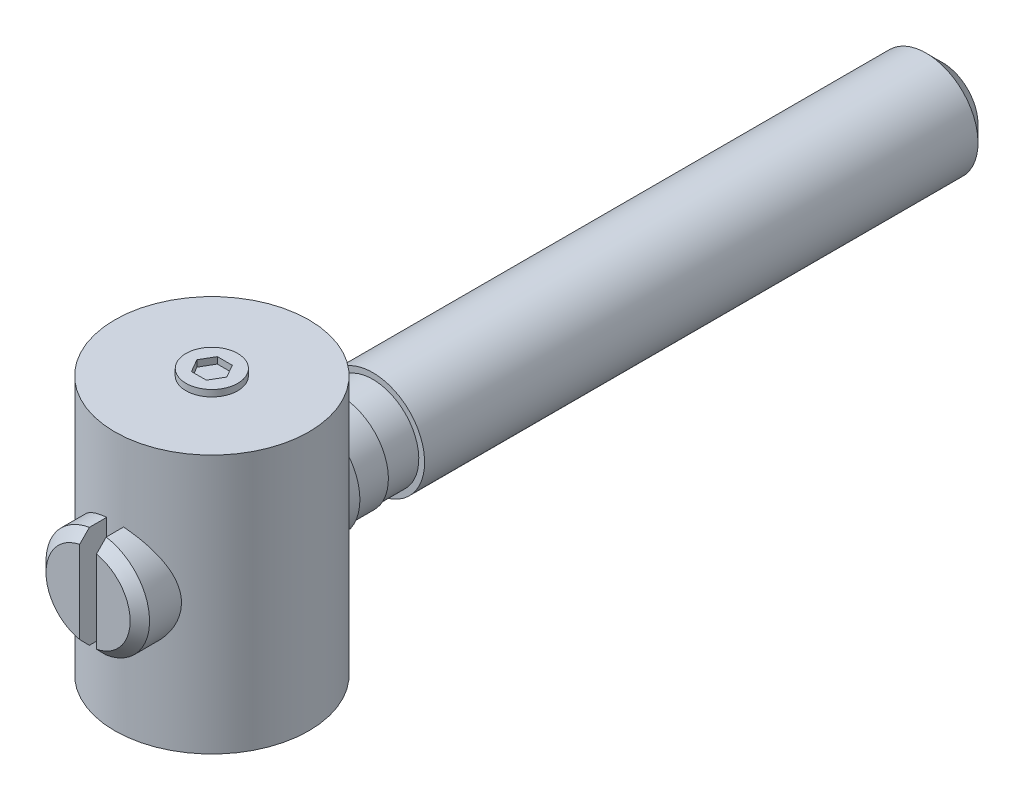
ISO-10303-21;
HEADER;
FILE_DESCRIPTION(('STEP AP214'),'2;1');
FILE_NAME('part.step','',(''),(''),'','','');
FILE_SCHEMA(('AUTOMOTIVE_DESIGN { 1 0 10303 214 1 1 1 1 }'));
ENDSEC;
DATA;
#1=APPLICATION_CONTEXT('core data for automotive mechanical design processes');
#2=APPLICATION_PROTOCOL_DEFINITION('international standard','automotive_design',2000,#1);
#3=PRODUCT_CONTEXT('',#1,'mechanical');
#4=PRODUCT('Part','Part','',(#3));
#5=PRODUCT_RELATED_PRODUCT_CATEGORY('part','',(#4));
#6=PRODUCT_DEFINITION_FORMATION('','',#4);
#7=PRODUCT_DEFINITION_CONTEXT('part definition',#1,'design');
#8=PRODUCT_DEFINITION('design','',#6,#7);
#9=PRODUCT_DEFINITION_SHAPE('','',#8);
#10=(LENGTH_UNIT() NAMED_UNIT(*) SI_UNIT(.MILLI.,.METRE.));
#11=(NAMED_UNIT(*) PLANE_ANGLE_UNIT() SI_UNIT($,.RADIAN.));
#12=(NAMED_UNIT(*) SI_UNIT($,.STERADIAN.) SOLID_ANGLE_UNIT());
#13=UNCERTAINTY_MEASURE_WITH_UNIT(LENGTH_MEASURE(1.E-05),#10,'distance_accuracy_value','');
#14=(GEOMETRIC_REPRESENTATION_CONTEXT(3) GLOBAL_UNCERTAINTY_ASSIGNED_CONTEXT((#13)) GLOBAL_UNIT_ASSIGNED_CONTEXT((#10,
#11,#12)) REPRESENTATION_CONTEXT('',''));
#15=CARTESIAN_POINT('',(0.,0.,0.));
#16=DIRECTION('',(0.,0.,1.));
#17=DIRECTION('',(1.,0.,0.));
#18=AXIS2_PLACEMENT_3D('',#15,#16,#17);
#19=CARTESIAN_POINT('',(0.,0.,9.56172630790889));
#20=DIRECTION('',(0.,0.,-1.));
#21=DIRECTION('',(0.,1.,0.));
#22=AXIS2_PLACEMENT_3D('',#19,#20,#21);
#23=PLANE('',#22);
#24=CARTESIAN_POINT('',(0.,0.,9.56172630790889));
#25=DIRECTION('',(0.,0.,-1.));
#26=DIRECTION('',(0.,1.,0.));
#27=AXIS2_PLACEMENT_3D('',#24,#25,#26);
#28=CIRCLE('',#27,3.25);
#29=CARTESIAN_POINT('',(0.65,-3.18433666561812,9.56172630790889));
#30=VERTEX_POINT('',#29);
#31=CARTESIAN_POINT('',(0.65,3.18433666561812,9.56172630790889));
#32=VERTEX_POINT('',#31);
#33=EDGE_CURVE('E181',#30,#32,#28,.F.);
#34=ORIENTED_EDGE('',*,*,#33,.T.);
#35=DIRECTION('',(0.,1.,0.));
#36=VECTOR('',#35,1.);
#37=CARTESIAN_POINT('',(0.65,3.94683417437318,9.56172630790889));
#38=LINE('',#37,#36);
#39=EDGE_CURVE('E373',#30,#32,#38,.T.);
#40=ORIENTED_EDGE('',*,*,#39,.F.);
#41=EDGE_LOOP('',(#34,#40));
#42=FACE_BOUND('',#41,.T.);
#43=ADVANCED_FACE('F14',(#42),#23,.F.);
#44=CARTESIAN_POINT('',(0.,0.,9.56172630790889));
#45=DIRECTION('',(0.,0.,-1.));
#46=DIRECTION('',(0.,1.,0.));
#47=AXIS2_PLACEMENT_3D('',#44,#45,#46);
#48=CONICAL_SURFACE('',#47,3.25,0.785398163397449);
#49=CARTESIAN_POINT('',(0.65,-8.70456504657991,4.08292612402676));
#50=CARTESIAN_POINT('',(0.650000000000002,-8.39669211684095,4.38993683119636));
#51=CARTESIAN_POINT('',(0.650000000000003,-8.08878101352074,4.69690929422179));
#52=CARTESIAN_POINT('',(0.650000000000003,-7.47282030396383,5.31073608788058));
#53=CARTESIAN_POINT('',(0.650000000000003,-7.16477069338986,5.61759041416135));
#54=CARTESIAN_POINT('',(0.650000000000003,-6.54823771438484,6.23137130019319));
#55=CARTESIAN_POINT('',(0.650000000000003,-6.2397541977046,6.53829771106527));
#56=CARTESIAN_POINT('',(0.650000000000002,-5.62251880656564,7.15186027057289));
#57=CARTESIAN_POINT('',(0.650000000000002,-5.31376694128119,7.45849642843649));
#58=CARTESIAN_POINT('',(0.650000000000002,-4.70842903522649,8.05879904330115));
#59=CARTESIAN_POINT('',(0.650000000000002,-4.41186110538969,8.3524837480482));
#60=CARTESIAN_POINT('',(0.650000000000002,-3.96643026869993,8.79245463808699));
#61=CARTESIAN_POINT('',(0.650000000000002,-3.81784936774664,8.93902624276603));
#62=CARTESIAN_POINT('',(0.650000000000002,-3.52042094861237,9.23189584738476));
#63=CARTESIAN_POINT('',(0.650000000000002,-3.37157343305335,9.37819384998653));
#64=CARTESIAN_POINT('',(0.650000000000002,-3.07356536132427,9.67032043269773));
#65=CARTESIAN_POINT('',(0.650000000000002,-2.92440500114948,9.81614921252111));
#66=CARTESIAN_POINT('',(0.650000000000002,-2.62547929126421,10.1071967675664));
#67=CARTESIAN_POINT('',(0.650000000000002,-2.47571391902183,10.252415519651));
#68=CARTESIAN_POINT('',(0.650000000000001,-2.17523512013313,10.5418211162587));
#69=CARTESIAN_POINT('',(0.650000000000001,-2.02452186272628,10.6860081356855));
#70=CARTESIAN_POINT('',(0.650000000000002,-1.79709748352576,10.9008470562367));
#71=CARTESIAN_POINT('',(0.650000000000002,-1.72106595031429,10.9722176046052));
#72=CARTESIAN_POINT('',(0.650000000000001,-1.5683474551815,11.1142531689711));
#73=CARTESIAN_POINT('',(0.65,-1.49166050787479,11.1849182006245));
#74=CARTESIAN_POINT('',(0.65,-1.37166741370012,11.2939463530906));
#75=CARTESIAN_POINT('',(0.650000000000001,-1.32870103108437,11.3326831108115));
#76=CARTESIAN_POINT('',(0.650000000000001,-1.2423737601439,11.4097235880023));
#77=CARTESIAN_POINT('',(0.650000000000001,-1.19901283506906,11.4480272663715));
#78=CARTESIAN_POINT('',(0.650000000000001,-1.1114937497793,11.5243047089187));
#79=CARTESIAN_POINT('',(0.650000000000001,-1.06733221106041,11.5622746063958));
#80=CARTESIAN_POINT('',(0.650000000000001,-0.978331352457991,11.6373918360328));
#81=CARTESIAN_POINT('',(0.65,-0.933492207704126,11.6745393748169));
#82=CARTESIAN_POINT('',(0.65,-0.842526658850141,11.7479491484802));
#83=CARTESIAN_POINT('',(0.650000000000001,-0.79639306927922,11.7842025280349));
#84=CARTESIAN_POINT('',(0.650000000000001,-0.702784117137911,11.8549284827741));
#85=CARTESIAN_POINT('',(0.650000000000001,-0.655309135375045,11.889401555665));
#86=CARTESIAN_POINT('',(0.650000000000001,-0.558661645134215,11.9553647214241));
#87=CARTESIAN_POINT('',(0.650000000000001,-0.509499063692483,11.9868691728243));
#88=CARTESIAN_POINT('',(0.650000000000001,-0.408485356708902,12.0451389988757));
#89=CARTESIAN_POINT('',(0.65,-0.356641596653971,12.0719165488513));
#90=CARTESIAN_POINT('',(0.65,-0.262880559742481,12.1115179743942));
#91=CARTESIAN_POINT('',(0.650000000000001,-0.221756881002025,12.1261577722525));
#92=CARTESIAN_POINT('',(0.650000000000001,-0.137737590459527,12.1485042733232));
#93=CARTESIAN_POINT('',(0.65,-0.0948516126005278,12.1562444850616));
#94=CARTESIAN_POINT('',(0.65,-0.0297912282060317,12.1614144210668));
#95=CARTESIAN_POINT('',(0.650000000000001,-0.007850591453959,12.162048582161));
#96=CARTESIAN_POINT('',(0.650000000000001,0.0359816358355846,12.1610997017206));
#97=CARTESIAN_POINT('',(0.650000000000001,0.0578732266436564,12.1595166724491));
#98=CARTESIAN_POINT('',(0.650000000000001,0.123263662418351,12.1515525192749));
#99=CARTESIAN_POINT('',(0.65,0.16638827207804,12.1419497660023));
#100=CARTESIAN_POINT('',(0.65,0.239287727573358,12.1197137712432));
#101=CARTESIAN_POINT('',(0.650000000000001,0.269558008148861,12.1085697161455));
#102=CARTESIAN_POINT('',(0.650000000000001,0.329032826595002,12.0836907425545));
#103=CARTESIAN_POINT('',(0.650000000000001,0.358236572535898,12.0699539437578));
#104=CARTESIAN_POINT('',(0.650000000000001,0.415789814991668,12.0405159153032));
#105=CARTESIAN_POINT('',(0.650000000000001,0.444134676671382,12.0248057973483));
#106=CARTESIAN_POINT('',(0.650000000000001,0.499980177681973,11.9919879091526));
#107=CARTESIAN_POINT('',(0.65,0.527481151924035,11.9748807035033));
#108=CARTESIAN_POINT('',(0.65,0.58686396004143,11.9363365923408));
#109=CARTESIAN_POINT('',(0.650000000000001,0.618606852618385,11.914687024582));
#110=CARTESIAN_POINT('',(0.650000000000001,0.681342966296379,11.8703234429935));
#111=CARTESIAN_POINT('',(0.650000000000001,0.712336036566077,11.8476092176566));
#112=CARTESIAN_POINT('',(0.65,0.804479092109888,11.778269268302));
#113=CARTESIAN_POINT('',(0.650000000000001,0.864747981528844,11.7304766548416));
#114=CARTESIAN_POINT('',(0.650000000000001,0.983937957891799,11.6329671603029));
#115=CARTESIAN_POINT('',(0.650000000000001,1.04285527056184,11.5832457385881));
#116=CARTESIAN_POINT('',(0.650000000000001,1.15965766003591,11.4826566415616));
#117=CARTESIAN_POINT('',(0.650000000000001,1.21754315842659,11.4317894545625));
#118=CARTESIAN_POINT('',(0.650000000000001,1.33273717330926,11.3291590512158));
#119=CARTESIAN_POINT('',(0.650000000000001,1.39004416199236,11.2773941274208));
#120=CARTESIAN_POINT('',(0.650000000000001,1.50415468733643,11.1733014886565));
#121=CARTESIAN_POINT('',(0.65,1.56095817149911,11.1209737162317));
#122=CARTESIAN_POINT('',(0.65,1.67409623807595,11.0159939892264));
#123=CARTESIAN_POINT('',(0.650000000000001,1.73043142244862,10.9633426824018));
#124=CARTESIAN_POINT('',(0.65,1.84281062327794,10.8577345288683));
#125=CARTESIAN_POINT('',(0.65,1.89885465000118,10.8047776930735));
#126=CARTESIAN_POINT('',(0.65,2.06557383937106,10.6465791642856));
#127=CARTESIAN_POINT('',(0.65,2.17592358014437,10.5409946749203));
#128=CARTESIAN_POINT('',(0.650000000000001,2.39606249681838,10.3292425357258));
#129=CARTESIAN_POINT('',(0.65,2.50585166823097,10.2230748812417));
#130=CARTESIAN_POINT('',(0.65,2.83466232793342,9.903984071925));
#131=CARTESIAN_POINT('',(0.65,3.05311972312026,9.69047999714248));
#132=CARTESIAN_POINT('',(0.65,3.48939994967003,9.26254806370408));
#133=CARTESIAN_POINT('',(0.65,3.70722228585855,9.04811970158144));
#134=CARTESIAN_POINT('',(0.65,4.14239678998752,8.61879348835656));
#135=CARTESIAN_POINT('',(0.65,4.35974896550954,8.40389564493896));
#136=CARTESIAN_POINT('',(0.65,4.79359052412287,7.97436233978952));
#137=CARTESIAN_POINT('',(0.65,5.01008067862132,7.7597276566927));
#138=CARTESIAN_POINT('',(0.65,5.4428610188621,7.33025496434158));
#139=CARTESIAN_POINT('',(0.649999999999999,5.65915120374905,7.11541695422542));
#140=CARTESIAN_POINT('',(0.65,6.30773962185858,6.47076507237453));
#141=CARTESIAN_POINT('',(0.650000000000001,6.7398288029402,6.04074089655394));
#142=CARTESIAN_POINT('',(0.65,7.2994784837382,5.48337298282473));
#143=CARTESIAN_POINT('',(0.649999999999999,7.42717743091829,5.3561681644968));
#144=CARTESIAN_POINT('',(0.649999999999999,7.68255536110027,5.10173055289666));
#145=CARTESIAN_POINT('',(0.649999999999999,7.81023434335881,4.9744977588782));
#146=CARTESIAN_POINT('',(0.649999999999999,8.065700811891,4.71988341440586));
#147=CARTESIAN_POINT('',(0.649999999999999,8.19348827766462,4.59250184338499));
#148=CARTESIAN_POINT('',(0.649999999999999,8.44904139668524,4.33772478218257));
#149=CARTESIAN_POINT('',(0.649999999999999,8.57680705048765,4.21032929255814));
#150=CARTESIAN_POINT('',(0.65,8.70456504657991,4.08292612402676));
#151=B_SPLINE_CURVE_WITH_KNOTS('',3,(#49,#50,#51,#52,#53,#54,#55,#56,#57,#58,#59,#60,#61,#62,
#63,#64,#65,#66,#67,#68,#69,#70,#71,#72,#73,#74,#75,#76,#77,#78,#79,#80,#81,#82,#83,#84,#85,#86,
#87,#88,#89,#90,#91,#92,#93,#94,#95,#96,#97,#98,#99,#100,#101,#102,#103,#104,#105,#106,#107,
#108,#109,#110,#111,#112,#113,#114,#115,#116,#117,#118,#119,#120,#121,#122,#123,#124,#125,#126,
#127,#128,#129,#130,#131,#132,#133,#134,#135,#136,#137,#138,#139,#140,#141,#142,#143,#144,#145,
#146,#147,#148,#149,#150),.UNSPECIFIED.,.F.,.F.,(4,2,2,2,2,2,2,2,2,2,2,2,2,2,2,2,2,2,2,2,2,2,2,
2,2,2,2,2,2,2,2,2,2,2,2,2,2,2,2,2,2,2,2,2,2,2,2,2,2,2,4),(0.,1.30436648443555,2.60877714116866,
3.9142627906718,5.21970543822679,6.4718343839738,7.09796165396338,7.72408279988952,
8.34988782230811,8.97571636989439,9.60143618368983,9.91427698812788,10.2271108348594,
10.4006593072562,10.5742241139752,10.7489387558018,10.9236089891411,11.0996044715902,
11.2755504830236,11.4505963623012,11.6251845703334,11.755746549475,11.8856709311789,
11.9514152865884,12.0171592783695,12.1489127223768,12.2455611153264,12.3422798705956,
12.4394510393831,12.5365831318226,12.6518208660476,12.7670815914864,12.9977655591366,
13.229030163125,13.4601980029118,13.6918683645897,13.9235626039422,14.1548884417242,
14.3862060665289,14.8443792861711,15.3025561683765,16.2189399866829,17.1359098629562,
18.0528648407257,18.9674270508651,19.881993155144,21.7108166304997,22.2515501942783,
22.7923005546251,23.3335965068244,23.8748755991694),.UNSPECIFIED.);
#152=CARTESIAN_POINT('',(0.65,-3.94683417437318,8.81172630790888));
#153=VERTEX_POINT('',#152);
#154=EDGE_CURVE('E95',#153,#30,#151,.T.);
#155=ORIENTED_EDGE('',*,*,#154,.F.);
#156=CARTESIAN_POINT('',(0.,0.,8.81172630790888));
#157=DIRECTION('',(0.,0.,-1.));
#158=DIRECTION('',(0.,1.,0.));
#159=AXIS2_PLACEMENT_3D('',#156,#157,#158);
#160=CIRCLE('',#159,4.);
#161=CARTESIAN_POINT('',(0.65,3.94683417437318,8.81172630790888));
#162=VERTEX_POINT('',#161);
#163=EDGE_CURVE('E186',#162,#153,#160,.T.);
#164=ORIENTED_EDGE('',*,*,#163,.F.);
#165=EDGE_CURVE('E195',#32,#162,#151,.T.);
#166=ORIENTED_EDGE('',*,*,#165,.F.);
#167=ORIENTED_EDGE('',*,*,#33,.F.);
#168=EDGE_LOOP('',(#155,#164,#166,#167));
#169=FACE_BOUND('',#168,.T.);
#170=ADVANCED_FACE('F211',(#169),#48,.T.);
#171=CARTESIAN_POINT('',(0.,0.,39.8570922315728));
#172=DIRECTION('',(0.,0.,1.));
#173=DIRECTION('',(0.,-1.,0.));
#174=AXIS2_PLACEMENT_3D('',#171,#172,#173);
#175=CYLINDRICAL_SURFACE('',#174,4.);
#176=CARTESIAN_POINT('',(0.,-4.,7.5));
#177=CARTESIAN_POINT('',(-0.104329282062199,-4.00000040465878,7.5000003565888));
#178=CARTESIAN_POINT('',(-0.20865297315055,-3.9959139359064,7.49781838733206));
#179=CARTESIAN_POINT('',(-0.416519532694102,-3.97962111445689,7.48914792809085));
#180=CARTESIAN_POINT('',(-0.520062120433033,-3.96741197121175,7.48265795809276));
#181=CARTESIAN_POINT('',(-0.725661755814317,-3.93500361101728,7.46552494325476));
#182=CARTESIAN_POINT('',(-0.827717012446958,-3.91479547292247,7.45487726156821));
#183=CARTESIAN_POINT('',(-1.02950974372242,-3.86663812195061,7.429702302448));
#184=CARTESIAN_POINT('',(-1.12924625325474,-3.83868574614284,7.41517343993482));
#185=CARTESIAN_POINT('',(-1.42307484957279,-3.74392721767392,7.36641110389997));
#186=CARTESIAN_POINT('',(-1.61285610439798,-3.66604732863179,7.32690726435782));
#187=CARTESIAN_POINT('',(-1.9762088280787,-3.4836808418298,7.23738512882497));
#188=CARTESIAN_POINT('',(-2.14978022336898,-3.37919412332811,7.18736678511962));
#189=CARTESIAN_POINT('',(-2.48882838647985,-3.13874131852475,7.07739524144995));
#190=CARTESIAN_POINT('',(-2.65301196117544,-3.00115110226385,7.01700391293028));
#191=CARTESIAN_POINT('',(-2.95716832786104,-2.70199516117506,6.89435393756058));
#192=CARTESIAN_POINT('',(-3.09711991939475,-2.54040866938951,6.83209371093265));
#193=CARTESIAN_POINT('',(-3.36178904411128,-2.18006310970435,6.70609881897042));
#194=CARTESIAN_POINT('',(-3.48395288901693,-1.9792578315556,6.64274760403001));
#195=CARTESIAN_POINT('',(-3.64013044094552,-1.66233743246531,6.55766590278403));
#196=CARTESIAN_POINT('',(-3.68768940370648,-1.55404047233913,6.53095573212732));
#197=CARTESIAN_POINT('',(-3.77327802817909,-1.33282028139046,6.48188273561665));
#198=CARTESIAN_POINT('',(-3.8113136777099,-1.21990000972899,6.45951718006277));
#199=CARTESIAN_POINT('',(-3.87528400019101,-0.997366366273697,6.42132989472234));
#200=CARTESIAN_POINT('',(-3.90182208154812,-0.887981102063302,6.40518874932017));
#201=CARTESIAN_POINT('',(-3.94564516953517,-0.666772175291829,6.37828721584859));
#202=CARTESIAN_POINT('',(-3.9629354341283,-0.554949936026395,6.36752377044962));
#203=CARTESIAN_POINT('',(-3.9879763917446,-0.329923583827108,6.35187091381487));
#204=CARTESIAN_POINT('',(-3.99573492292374,-0.21672068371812,6.3469766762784));
#205=CARTESIAN_POINT('',(-4.00159448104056,0.0100266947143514,6.34328425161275));
#206=CARTESIAN_POINT('',(-3.99969667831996,0.123571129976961,6.34448532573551));
#207=CARTESIAN_POINT('',(-3.98722972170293,0.333880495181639,6.35232566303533));
#208=CARTESIAN_POINT('',(-3.97792191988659,0.430752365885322,6.35817365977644));
#209=CARTESIAN_POINT('',(-3.95234427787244,0.62322962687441,6.37410335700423));
#210=CARTESIAN_POINT('',(-3.93607229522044,0.718834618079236,6.38418636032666));
#211=CARTESIAN_POINT('',(-3.87707963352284,1.00276725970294,6.42031483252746));
#212=CARTESIAN_POINT('',(-3.82417439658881,1.18833960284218,6.45224517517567));
#213=CARTESIAN_POINT('',(-3.69194831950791,1.55171916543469,6.52881406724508));
#214=CARTESIAN_POINT('',(-3.61206074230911,1.72925828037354,6.57372199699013));
#215=CARTESIAN_POINT('',(-3.42858159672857,2.06934086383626,6.67125272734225));
#216=CARTESIAN_POINT('',(-3.32497952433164,2.23187764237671,6.72387894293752));
#217=CARTESIAN_POINT('',(-3.07935066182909,2.56242703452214,6.84022433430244));
#218=CARTESIAN_POINT('',(-2.93391468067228,2.72773501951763,6.90443725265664));
#219=CARTESIAN_POINT('',(-2.6172236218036,3.03289545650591,7.03058565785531));
#220=CARTESIAN_POINT('',(-2.44595290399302,3.17273237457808,7.09251973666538));
#221=CARTESIAN_POINT('',(-2.16676749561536,3.36435932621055,7.18091003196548));
#222=CARTESIAN_POINT('',(-2.06686725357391,3.42666004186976,7.21036936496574));
#223=CARTESIAN_POINT('',(-1.86130318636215,3.54252047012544,7.26614530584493));
#224=CARTESIAN_POINT('',(-1.75564184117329,3.59608390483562,7.29246325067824));
#225=CARTESIAN_POINT('',(-1.53927716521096,3.69387554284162,7.34117979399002));
#226=CARTESIAN_POINT('',(-1.42857623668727,3.73810813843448,7.36358023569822));
#227=CARTESIAN_POINT('',(-1.20291776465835,3.81670749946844,7.40379052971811));
#228=CARTESIAN_POINT('',(-1.08796078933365,3.85107557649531,7.42160099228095));
#229=CARTESIAN_POINT('',(-0.865261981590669,3.90682600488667,7.45068973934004));
#230=CARTESIAN_POINT('',(-0.757800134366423,3.92909777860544,7.46241120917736));
#231=CARTESIAN_POINT('',(-0.541018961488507,3.96476496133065,7.48125196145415));
#232=CARTESIAN_POINT('',(-0.431699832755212,3.97816130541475,7.48837172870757));
#233=CARTESIAN_POINT('',(-0.212172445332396,3.99588587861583,7.49780284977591));
#234=CARTESIAN_POINT('',(-0.101964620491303,4.00021829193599,7.50011642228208));
#235=CARTESIAN_POINT('',(0.118422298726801,3.99976477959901,7.4998745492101));
#236=CARTESIAN_POINT('',(0.228601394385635,3.99497937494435,7.49731938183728));
#237=CARTESIAN_POINT('',(0.437982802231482,3.97720766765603,7.48786549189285));
#238=CARTESIAN_POINT('',(0.537271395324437,3.96500748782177,7.48138330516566));
#239=CARTESIAN_POINT('',(0.734354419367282,3.93328142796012,7.46461842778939));
#240=CARTESIAN_POINT('',(0.832148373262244,3.9137532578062,7.4543345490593));
#241=CARTESIAN_POINT('',(1.12223852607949,3.84447795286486,7.41811350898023));
#242=CARTESIAN_POINT('',(1.31143028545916,3.78402368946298,7.38679785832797));
#243=CARTESIAN_POINT('',(1.68128124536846,3.63512086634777,7.31162738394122));
#244=CARTESIAN_POINT('',(1.86161005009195,3.54601184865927,7.26747936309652));
#245=CARTESIAN_POINT('',(2.20530240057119,3.34312620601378,7.1706722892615));
#246=CARTESIAN_POINT('',(2.36865928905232,3.22933995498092,7.11800991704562));
#247=CARTESIAN_POINT('',(2.69245168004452,2.96627213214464,7.00238186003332));
#248=CARTESIAN_POINT('',(2.85067860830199,2.81448780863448,6.93891733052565));
#249=CARTESIAN_POINT('',(3.14054502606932,2.48694968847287,6.8126367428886));
#250=CARTESIAN_POINT('',(3.27215988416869,2.31117393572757,6.74982133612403));
#251=CARTESIAN_POINT('',(3.51371844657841,1.92581246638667,6.62747054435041));
#252=CARTESIAN_POINT('',(3.62160676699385,1.71474727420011,6.56844065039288));
#253=CARTESIAN_POINT('',(3.75479280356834,1.38408550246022,6.49262165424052));
#254=CARTESIAN_POINT('',(3.79441212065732,1.2715285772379,6.46947070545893));
#255=CARTESIAN_POINT('',(3.86363310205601,1.04241683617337,6.42837188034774));
#256=CARTESIAN_POINT('',(3.89323655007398,0.925862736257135,6.41042307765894));
#257=CARTESIAN_POINT('',(3.93952982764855,0.701376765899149,6.38206607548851));
#258=CARTESIAN_POINT('',(3.9571999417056,0.593717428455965,6.37109180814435));
#259=CARTESIAN_POINT('',(3.98369950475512,0.376909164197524,6.35455615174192));
#260=CARTESIAN_POINT('',(3.99253018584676,0.267760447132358,6.34899400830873));
#261=CARTESIAN_POINT('',(4.00119558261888,0.0490176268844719,6.343537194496));
#262=CARTESIAN_POINT('',(4.00103521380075,-0.0605762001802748,6.34363942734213));
#263=CARTESIAN_POINT('',(3.99174615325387,-0.279197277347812,6.34948650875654));
#264=CARTESIAN_POINT('',(3.98261805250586,-0.388224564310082,6.3552309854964));
#265=CARTESIAN_POINT('',(3.94527417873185,-0.68659497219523,6.37853289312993));
#266=CARTESIAN_POINT('',(3.90785104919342,-0.874437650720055,6.40173425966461));
#267=CARTESIAN_POINT('',(3.80746909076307,-1.24070660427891,6.46192910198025));
#268=CARTESIAN_POINT('',(3.74450079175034,-1.41912935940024,6.49892769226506));
#269=CARTESIAN_POINT('',(3.59040170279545,-1.77451283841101,6.58538478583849));
#270=CARTESIAN_POINT('',(3.4977179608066,-1.950638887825,6.63549242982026));
#271=CARTESIAN_POINT('',(3.28835420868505,-2.28601363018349,6.74169802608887));
#272=CARTESIAN_POINT('',(3.17166127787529,-2.44525316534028,6.7977991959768));
#273=CARTESIAN_POINT('',(2.8979268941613,-2.76636004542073,6.91936180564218));
#274=CARTESIAN_POINT('',(2.73749066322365,-2.92527561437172,6.98500336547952));
#275=CARTESIAN_POINT('',(2.39071522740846,-3.21487945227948,7.11114874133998));
#276=CARTESIAN_POINT('',(2.20435938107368,-3.34554944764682,7.17164921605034));
#277=CARTESIAN_POINT('',(1.90608771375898,-3.51859665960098,7.2545091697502));
#278=CARTESIAN_POINT('',(1.80214051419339,-3.57297318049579,7.2810899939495));
#279=CARTESIAN_POINT('',(1.58915491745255,-3.67265414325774,7.33051892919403));
#280=CARTESIAN_POINT('',(1.48011905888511,-3.71796305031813,7.35336887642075));
#281=CARTESIAN_POINT('',(1.2579483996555,-3.79888380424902,7.39461358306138));
#282=CARTESIAN_POINT('',(1.14482237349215,-3.83451515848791,7.4130172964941));
#283=CARTESIAN_POINT('',(0.915246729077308,-3.89569281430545,7.44484645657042));
#284=CARTESIAN_POINT('',(0.798798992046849,-3.92124470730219,7.45827466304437));
#285=CARTESIAN_POINT('',(0.569078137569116,-3.96094679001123,7.47922653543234));
#286=CARTESIAN_POINT('',(0.455909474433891,-3.97557224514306,7.48699590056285));
#287=CARTESIAN_POINT('',(0.228491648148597,-3.99509868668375,7.49738246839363));
#288=CARTESIAN_POINT('',(0.114242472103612,-3.99999955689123,7.49999960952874));
#289=CARTESIAN_POINT('',(0.,-4.,7.5));
#290=B_SPLINE_CURVE_WITH_KNOTS('',3,(#176,#177,#178,#179,#180,#181,#182,#183,#184,#185,#186,
#187,#188,#189,#190,#191,#192,#193,#194,#195,#196,#197,#198,#199,#200,#201,#202,#203,#204,#205,
#206,#207,#208,#209,#210,#211,#212,#213,#214,#215,#216,#217,#218,#219,#220,#221,#222,#223,#224,
#225,#226,#227,#228,#229,#230,#231,#232,#233,#234,#235,#236,#237,#238,#239,#240,#241,#242,#243,
#244,#245,#246,#247,#248,#249,#250,#251,#252,#253,#254,#255,#256,#257,#258,#259,#260,#261,#262,
#263,#264,#265,#266,#267,#268,#269,#270,#271,#272,#273,#274,#275,#276,#277,#278,#279,#280,#281,
#282,#283,#284,#285,#286,#287,#288,#289),.UNSPECIFIED.,.T.,.F.,(4,2,2,2,2,2,2,2,2,2,2,2,2,2,2,2,
2,2,2,2,2,2,2,2,2,2,2,2,2,2,2,2,2,2,2,2,2,2,2,2,2,2,2,2,2,2,2,2,2,2,2,2,2,2,2,2,4),(0.,
0.312875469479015,0.625858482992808,0.939191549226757,1.25265277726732,1.87635275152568,
2.50005555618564,3.16498046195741,3.83048419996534,4.55668682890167,4.92002643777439,
5.28313701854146,5.6237663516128,5.96420180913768,6.30435713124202,6.64447122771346,
6.93659372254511,7.22880615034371,7.81285364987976,8.41002203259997,9.0074554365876,
9.69267368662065,10.3783084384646,10.7419894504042,11.1055151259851,11.4688692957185,
11.832175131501,12.1628321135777,12.4934542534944,12.8239237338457,13.1543743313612,
13.4547461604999,13.7552119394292,14.3555858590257,14.9709302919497,15.5865151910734,
16.2683843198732,16.9508817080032,17.6793249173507,18.0434998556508,18.407609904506,
18.736085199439,19.0645147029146,19.3927646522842,19.720992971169,20.2969971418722,
20.8732150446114,21.4865540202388,22.1002239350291,22.8026614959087,23.5055521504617,
23.8659835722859,24.2262370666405,24.5857589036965,24.9450810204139,25.2876812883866,
25.6302856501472),.UNSPECIFIED.);
#291=CARTESIAN_POINT('',(0.65,3.94683417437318,7.47178024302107));
#292=VERTEX_POINT('',#291);
#293=CARTESIAN_POINT('',(0.65,-3.94683417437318,7.47178024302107));
#294=VERTEX_POINT('',#293);
#295=EDGE_CURVE('E398',#292,#294,#290,.T.);
#296=ORIENTED_EDGE('',*,*,#295,.F.);
#297=DIRECTION('',(0.,0.,1.));
#298=VECTOR('',#297,1.);
#299=CARTESIAN_POINT('',(0.65,3.94683417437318,7.06172630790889));
#300=LINE('',#299,#298);
#301=EDGE_CURVE('E387',#292,#162,#300,.T.);
#302=ORIENTED_EDGE('',*,*,#301,.T.);
#303=ORIENTED_EDGE('',*,*,#163,.T.);
#304=DIRECTION('',(0.,0.,1.));
#305=VECTOR('',#304,1.);
#306=CARTESIAN_POINT('',(0.65,-3.94683417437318,7.06172630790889));
#307=LINE('',#306,#305);
#308=EDGE_CURVE('E379',#294,#153,#307,.T.);
#309=ORIENTED_EDGE('',*,*,#308,.F.);
#310=EDGE_LOOP('',(#296,#302,#303,#309));
#311=FACE_BOUND('',#310,.T.);
#312=ADVANCED_FACE('F220',(#311),#175,.T.);
#313=CARTESIAN_POINT('',(0.65,3.94683417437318,7.06172630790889));
#314=DIRECTION('',(1.,0.,0.));
#315=DIRECTION('',(0.,1.,0.));
#316=AXIS2_PLACEMENT_3D('',#313,#314,#315);
#317=PLANE('',#316);
#318=DIRECTION('',(0.,1.,0.));
#319=VECTOR('',#318,1.);
#320=CARTESIAN_POINT('',(0.65,-10.,7.47178024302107));
#321=LINE('',#320,#319);
#322=EDGE_CURVE('E390',#294,#292,#321,.T.);
#323=ORIENTED_EDGE('',*,*,#322,.F.);
#324=ORIENTED_EDGE('',*,*,#308,.T.);
#325=ORIENTED_EDGE('',*,*,#154,.T.);
#326=ORIENTED_EDGE('',*,*,#39,.T.);
#327=ORIENTED_EDGE('',*,*,#165,.T.);
#328=ORIENTED_EDGE('',*,*,#301,.F.);
#329=EDGE_LOOP('',(#323,#324,#325,#326,#327,#328));
#330=FACE_BOUND('',#329,.T.);
#331=ADVANCED_FACE('F215',(#330),#317,.F.);
#332=CARTESIAN_POINT('',(0.,10.,0.));
#333=DIRECTION('',(0.,1.,0.));
#334=DIRECTION('',(-1.,0.,0.));
#335=AXIS2_PLACEMENT_3D('',#332,#333,#334);
#336=PLANE('',#335);
#337=DIRECTION('',(-1.,0.,0.));
#338=VECTOR('',#337,1.);
#339=CARTESIAN_POINT('',(-0.57735026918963,10.,1.));
#340=LINE('',#339,#338);
#341=CARTESIAN_POINT('',(0.577350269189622,10.,1.));
#342=VERTEX_POINT('',#341);
#343=CARTESIAN_POINT('',(-0.57735026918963,10.,1.));
#344=VERTEX_POINT('',#343);
#345=EDGE_CURVE('E413',#342,#344,#340,.T.);
#346=ORIENTED_EDGE('',*,*,#345,.F.);
#347=DIRECTION('',(-0.5,0.,0.866025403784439));
#348=VECTOR('',#347,1.);
#349=CARTESIAN_POINT('',(0.577350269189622,10.,1.));
#350=LINE('',#349,#348);
#351=CARTESIAN_POINT('',(1.15470053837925,10.,0.));
#352=VERTEX_POINT('',#351);
#353=EDGE_CURVE('E410',#352,#342,#350,.T.);
#354=ORIENTED_EDGE('',*,*,#353,.F.);
#355=DIRECTION('',(0.5,0.,0.866025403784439));
#356=VECTOR('',#355,1.);
#357=CARTESIAN_POINT('',(1.15470053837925,10.,0.));
#358=LINE('',#357,#356);
#359=CARTESIAN_POINT('',(0.577350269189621,10.,-1.));
#360=VERTEX_POINT('',#359);
#361=EDGE_CURVE('E339',#360,#352,#358,.T.);
#362=ORIENTED_EDGE('',*,*,#361,.F.);
#363=DIRECTION('',(1.,0.,0.));
#364=VECTOR('',#363,1.);
#365=CARTESIAN_POINT('',(0.577350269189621,10.,-1.));
#366=LINE('',#365,#364);
#367=CARTESIAN_POINT('',(-0.57735026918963,10.,-1.));
#368=VERTEX_POINT('',#367);
#369=EDGE_CURVE('E407',#368,#360,#366,.T.);
#370=ORIENTED_EDGE('',*,*,#369,.F.);
#371=DIRECTION('',(0.5,0.,-0.866025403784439));
#372=VECTOR('',#371,1.);
#373=CARTESIAN_POINT('',(-0.57735026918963,10.,-1.));
#374=LINE('',#373,#372);
#375=CARTESIAN_POINT('',(-1.15470053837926,10.,0.));
#376=VERTEX_POINT('',#375);
#377=EDGE_CURVE('E86',#376,#368,#374,.T.);
#378=ORIENTED_EDGE('',*,*,#377,.F.);
#379=DIRECTION('',(-0.5,0.,-0.866025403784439));
#380=VECTOR('',#379,1.);
#381=CARTESIAN_POINT('',(-1.15470053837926,10.,0.));
#382=LINE('',#381,#380);
#383=EDGE_CURVE('E404',#344,#376,#382,.T.);
#384=ORIENTED_EDGE('',*,*,#383,.F.);
#385=EDGE_LOOP('',(#346,#354,#362,#370,#378,#384));
#386=FACE_BOUND('',#385,.T.);
#387=ADVANCED_FACE('F219',(#386),#336,.T.);
#388=CARTESIAN_POINT('',(-0.57735026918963,9.,1.));
#389=DIRECTION('',(0.,0.,1.));
#390=DIRECTION('',(1.,0.,0.));
#391=AXIS2_PLACEMENT_3D('',#388,#389,#390);
#392=PLANE('',#391);
#393=DIRECTION('',(0.,1.,0.));
#394=VECTOR('',#393,1.);
#395=CARTESIAN_POINT('',(0.577350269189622,9.,1.));
#396=LINE('',#395,#394);
#397=CARTESIAN_POINT('',(0.577350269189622,10.5,1.));
#398=VERTEX_POINT('',#397);
#399=EDGE_CURVE('E349',#342,#398,#396,.T.);
#400=ORIENTED_EDGE('',*,*,#399,.F.);
#401=ORIENTED_EDGE('',*,*,#345,.T.);
#402=DIRECTION('',(0.,1.,0.));
#403=VECTOR('',#402,1.);
#404=CARTESIAN_POINT('',(-0.57735026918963,9.,1.));
#405=LINE('',#404,#403);
#406=CARTESIAN_POINT('',(-0.57735026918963,10.5,1.));
#407=VERTEX_POINT('',#406);
#408=EDGE_CURVE('E80',#344,#407,#405,.T.);
#409=ORIENTED_EDGE('',*,*,#408,.T.);
#410=DIRECTION('',(1.,0.,0.));
#411=VECTOR('',#410,1.);
#412=CARTESIAN_POINT('',(-0.57735026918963,10.5,1.));
#413=LINE('',#412,#411);
#414=EDGE_CURVE('E362',#407,#398,#413,.T.);
#415=ORIENTED_EDGE('',*,*,#414,.T.);
#416=EDGE_LOOP('',(#400,#401,#409,#415));
#417=FACE_BOUND('',#416,.T.);
#418=ADVANCED_FACE('F300',(#417),#392,.F.);
#419=CARTESIAN_POINT('',(0.577350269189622,9.,1.));
#420=DIRECTION('',(0.866025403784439,0.,0.5));
#421=DIRECTION('',(0.5,0.,-0.866025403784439));
#422=AXIS2_PLACEMENT_3D('',#419,#420,#421);
#423=PLANE('',#422);
#424=DIRECTION('',(0.,1.,0.));
#425=VECTOR('',#424,1.);
#426=CARTESIAN_POINT('',(1.15470053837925,9.,0.));
#427=LINE('',#426,#425);
#428=CARTESIAN_POINT('',(1.15470053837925,10.5,0.));
#429=VERTEX_POINT('',#428);
#430=EDGE_CURVE('E346',#352,#429,#427,.T.);
#431=ORIENTED_EDGE('',*,*,#430,.F.);
#432=ORIENTED_EDGE('',*,*,#353,.T.);
#433=ORIENTED_EDGE('',*,*,#399,.T.);
#434=DIRECTION('',(0.5,0.,-0.866025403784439));
#435=VECTOR('',#434,1.);
#436=CARTESIAN_POINT('',(0.577350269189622,10.5,1.));
#437=LINE('',#436,#435);
#438=EDGE_CURVE('E359',#398,#429,#437,.T.);
#439=ORIENTED_EDGE('',*,*,#438,.T.);
#440=EDGE_LOOP('',(#431,#432,#433,#439));
#441=FACE_BOUND('',#440,.T.);
#442=ADVANCED_FACE('F306',(#441),#423,.F.);
#443=CARTESIAN_POINT('',(1.15470053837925,9.,0.));
#444=DIRECTION('',(0.866025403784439,0.,-0.5));
#445=DIRECTION('',(-0.5,0.,-0.866025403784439));
#446=AXIS2_PLACEMENT_3D('',#443,#444,#445);
#447=PLANE('',#446);
#448=DIRECTION('',(0.,1.,0.));
#449=VECTOR('',#448,1.);
#450=CARTESIAN_POINT('',(0.577350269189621,9.,-1.));
#451=LINE('',#450,#449);
#452=CARTESIAN_POINT('',(0.577350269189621,10.5,-1.));
#453=VERTEX_POINT('',#452);
#454=EDGE_CURVE('E338',#360,#453,#451,.T.);
#455=ORIENTED_EDGE('',*,*,#454,.F.);
#456=ORIENTED_EDGE('',*,*,#361,.T.);
#457=ORIENTED_EDGE('',*,*,#430,.T.);
#458=DIRECTION('',(-0.5,0.,-0.866025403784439));
#459=VECTOR('',#458,1.);
#460=CARTESIAN_POINT('',(1.15470053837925,10.5,0.));
#461=LINE('',#460,#459);
#462=EDGE_CURVE('E342',#429,#453,#461,.T.);
#463=ORIENTED_EDGE('',*,*,#462,.T.);
#464=EDGE_LOOP('',(#455,#456,#457,#463));
#465=FACE_BOUND('',#464,.T.);
#466=ADVANCED_FACE('F326',(#465),#447,.F.);
#467=CARTESIAN_POINT('',(0.577350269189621,9.,-1.));
#468=DIRECTION('',(0.,0.,-1.));
#469=DIRECTION('',(-1.,0.,0.));
#470=AXIS2_PLACEMENT_3D('',#467,#468,#469);
#471=PLANE('',#470);
#472=DIRECTION('',(0.,1.,0.));
#473=VECTOR('',#472,1.);
#474=CARTESIAN_POINT('',(-0.57735026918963,9.,-1.));
#475=LINE('',#474,#473);
#476=CARTESIAN_POINT('',(-0.57735026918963,10.5,-1.));
#477=VERTEX_POINT('',#476);
#478=EDGE_CURVE('E347',#368,#477,#475,.T.);
#479=ORIENTED_EDGE('',*,*,#478,.F.);
#480=ORIENTED_EDGE('',*,*,#369,.T.);
#481=ORIENTED_EDGE('',*,*,#454,.T.);
#482=DIRECTION('',(-1.,0.,0.));
#483=VECTOR('',#482,1.);
#484=CARTESIAN_POINT('',(0.577350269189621,10.5,-1.));
#485=LINE('',#484,#483);
#486=EDGE_CURVE('E355',#453,#477,#485,.T.);
#487=ORIENTED_EDGE('',*,*,#486,.T.);
#488=EDGE_LOOP('',(#479,#480,#481,#487));
#489=FACE_BOUND('',#488,.T.);
#490=ADVANCED_FACE('F253',(#489),#471,.F.);
#491=CARTESIAN_POINT('',(-0.57735026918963,9.,-1.));
#492=DIRECTION('',(-0.866025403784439,0.,-0.5));
#493=DIRECTION('',(-0.5,0.,0.866025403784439));
#494=AXIS2_PLACEMENT_3D('',#491,#492,#493);
#495=PLANE('',#494);
#496=DIRECTION('',(0.,1.,0.));
#497=VECTOR('',#496,1.);
#498=CARTESIAN_POINT('',(-1.15470053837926,9.,0.));
#499=LINE('',#498,#497);
#500=CARTESIAN_POINT('',(-1.15470053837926,10.5,0.));
#501=VERTEX_POINT('',#500);
#502=EDGE_CURVE('E357',#376,#501,#499,.T.);
#503=ORIENTED_EDGE('',*,*,#502,.F.);
#504=ORIENTED_EDGE('',*,*,#377,.T.);
#505=ORIENTED_EDGE('',*,*,#478,.T.);
#506=DIRECTION('',(-0.5,0.,0.866025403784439));
#507=VECTOR('',#506,1.);
#508=CARTESIAN_POINT('',(-0.57735026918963,10.5,-1.));
#509=LINE('',#508,#507);
#510=EDGE_CURVE('E366',#477,#501,#509,.T.);
#511=ORIENTED_EDGE('',*,*,#510,.T.);
#512=EDGE_LOOP('',(#503,#504,#505,#511));
#513=FACE_BOUND('',#512,.T.);
#514=ADVANCED_FACE('F318',(#513),#495,.F.);
#515=CARTESIAN_POINT('',(-1.15470053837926,9.,0.));
#516=DIRECTION('',(-0.866025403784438,0.,0.5));
#517=DIRECTION('',(0.5,0.,0.866025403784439));
#518=AXIS2_PLACEMENT_3D('',#515,#516,#517);
#519=PLANE('',#518);
#520=ORIENTED_EDGE('',*,*,#408,.F.);
#521=ORIENTED_EDGE('',*,*,#383,.T.);
#522=ORIENTED_EDGE('',*,*,#502,.T.);
#523=DIRECTION('',(0.5,0.,0.866025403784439));
#524=VECTOR('',#523,1.);
#525=CARTESIAN_POINT('',(-1.15470053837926,10.5,0.));
#526=LINE('',#525,#524);
#527=EDGE_CURVE('E364',#501,#407,#526,.T.);
#528=ORIENTED_EDGE('',*,*,#527,.T.);
#529=EDGE_LOOP('',(#520,#521,#522,#528));
#530=FACE_BOUND('',#529,.T.);
#531=ADVANCED_FACE('F316',(#530),#519,.F.);
#532=CARTESIAN_POINT('',(0.,10.5,0.));
#533=DIRECTION('',(0.,-1.,0.));
#534=DIRECTION('',(1.,0.,0.));
#535=AXIS2_PLACEMENT_3D('',#532,#533,#534);
#536=PLANE('',#535);
#537=ORIENTED_EDGE('',*,*,#527,.F.);
#538=ORIENTED_EDGE('',*,*,#510,.F.);
#539=ORIENTED_EDGE('',*,*,#486,.F.);
#540=ORIENTED_EDGE('',*,*,#462,.F.);
#541=ORIENTED_EDGE('',*,*,#438,.F.);
#542=ORIENTED_EDGE('',*,*,#414,.F.);
#543=EDGE_LOOP('',(#537,#538,#539,#540,#541,#542));
#544=FACE_BOUND('',#543,.T.);
#545=CARTESIAN_POINT('',(0.,10.5,0.));
#546=DIRECTION('',(0.,-1.,0.));
#547=DIRECTION('',(1.,0.,0.));
#548=AXIS2_PLACEMENT_3D('',#545,#546,#547);
#549=CIRCLE('',#548,2.);
#550=CARTESIAN_POINT('',(2.,10.5,0.));
#551=VERTEX_POINT('',#550);
#552=EDGE_CURVE('E351',#551,#551,#549,.T.);
#553=ORIENTED_EDGE('',*,*,#552,.F.);
#554=EDGE_LOOP('',(#553));
#555=FACE_BOUND('',#554,.T.);
#556=ADVANCED_FACE('F312',(#544,#555),#536,.F.);
#557=CARTESIAN_POINT('',(0.,6.5,0.));
#558=DIRECTION('',(0.,-1.,0.));
#559=DIRECTION('',(1.,0.,0.));
#560=AXIS2_PLACEMENT_3D('',#557,#558,#559);
#561=CYLINDRICAL_SURFACE('',#560,2.);
#562=ORIENTED_EDGE('',*,*,#552,.T.);
#563=EDGE_LOOP('',(#562));
#564=FACE_BOUND('',#563,.T.);
#565=CARTESIAN_POINT('',(0.,10.,0.));
#566=DIRECTION('',(0.,-1.,0.));
#567=DIRECTION('',(1.,0.,0.));
#568=AXIS2_PLACEMENT_3D('',#565,#566,#567);
#569=CIRCLE('',#568,2.);
#570=CARTESIAN_POINT('',(2.,10.,0.));
#571=VERTEX_POINT('',#570);
#572=EDGE_CURVE('E415',#571,#571,#569,.T.);
#573=ORIENTED_EDGE('',*,*,#572,.F.);
#574=EDGE_LOOP('',(#573));
#575=FACE_BOUND('',#574,.T.);
#576=ADVANCED_FACE('F309',(#564,#575),#561,.T.);
#577=CARTESIAN_POINT('',(0.,-10.,0.));
#578=DIRECTION('',(0.,-1.,0.));
#579=DIRECTION('',(1.,0.,0.));
#580=AXIS2_PLACEMENT_3D('',#577,#578,#579);
#581=PLANE('',#580);
#582=CARTESIAN_POINT('',(0.,-10.,0.));
#583=DIRECTION('',(0.,-1.,0.));
#584=DIRECTION('',(1.,0.,0.));
#585=AXIS2_PLACEMENT_3D('',#582,#583,#584);
#586=CIRCLE('',#585,7.5);
#587=CARTESIAN_POINT('',(7.5,-10.,0.));
#588=VERTEX_POINT('',#587);
#589=EDGE_CURVE('E369',#588,#588,#586,.T.);
#590=ORIENTED_EDGE('',*,*,#589,.T.);
#591=EDGE_LOOP('',(#590));
#592=FACE_BOUND('',#591,.T.);
#593=ADVANCED_FACE('F255',(#592),#581,.T.);
#594=CARTESIAN_POINT('',(0.,10.,0.));
#595=DIRECTION('',(0.,-1.,0.));
#596=DIRECTION('',(1.,0.,0.));
#597=AXIS2_PLACEMENT_3D('',#594,#595,#596);
#598=PLANE('',#597);
#599=CARTESIAN_POINT('',(0.,10.,0.));
#600=DIRECTION('',(0.,-1.,0.));
#601=DIRECTION('',(1.,0.,0.));
#602=AXIS2_PLACEMENT_3D('',#599,#600,#601);
#603=CIRCLE('',#602,7.5);
#604=CARTESIAN_POINT('',(7.5,10.,0.));
#605=VERTEX_POINT('',#604);
#606=EDGE_CURVE('E371',#605,#605,#603,.T.);
#607=ORIENTED_EDGE('',*,*,#606,.F.);
#608=EDGE_LOOP('',(#607));
#609=FACE_BOUND('',#608,.T.);
#610=ORIENTED_EDGE('',*,*,#572,.T.);
#611=EDGE_LOOP('',(#610));
#612=FACE_BOUND('',#611,.T.);
#613=ADVANCED_FACE('F16',(#609,#612),#598,.F.);
#614=CARTESIAN_POINT('',(0.,-10.,0.));
#615=DIRECTION('',(0.,1.,0.));
#616=DIRECTION('',(-1.,0.,0.));
#617=AXIS2_PLACEMENT_3D('',#614,#615,#616);
#618=CYLINDRICAL_SURFACE('',#617,7.5);
#619=DIRECTION('',(0.,1.,0.));
#620=VECTOR('',#619,1.);
#621=CARTESIAN_POINT('',(-0.65,-10.,7.47178024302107));
#622=LINE('',#621,#620);
#623=CARTESIAN_POINT('',(-0.65,3.94683417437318,7.47178024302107));
#624=VERTEX_POINT('',#623);
#625=CARTESIAN_POINT('',(-0.65,-3.94683417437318,7.47178024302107));
#626=VERTEX_POINT('',#625);
#627=EDGE_CURVE('E248',#624,#626,#622,.F.);
#628=ORIENTED_EDGE('',*,*,#627,.T.);
#629=EDGE_CURVE('E237',#626,#624,#290,.T.);
#630=ORIENTED_EDGE('',*,*,#629,.T.);
#631=EDGE_LOOP('',(#628,#630));
#632=FACE_BOUND('',#631,.T.);
#633=ORIENTED_EDGE('',*,*,#606,.T.);
#634=EDGE_LOOP('',(#633));
#635=FACE_BOUND('',#634,.T.);
#636=ORIENTED_EDGE('',*,*,#589,.F.);
#637=EDGE_LOOP('',(#636));
#638=FACE_BOUND('',#637,.T.);
#639=ORIENTED_EDGE('',*,*,#322,.T.);
#640=ORIENTED_EDGE('',*,*,#295,.T.);
#641=EDGE_LOOP('',(#639,#640));
#642=FACE_BOUND('',#641,.T.);
#643=DIRECTION('',(0.,1.,0.));
#644=VECTOR('',#643,1.);
#645=CARTESIAN_POINT('',(-0.960252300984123,-10.,-7.43827369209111));
#646=LINE('',#645,#644);
#647=CARTESIAN_POINT('',(-0.960252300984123,3.57322200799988,-7.43827369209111));
#648=VERTEX_POINT('',#647);
#649=CARTESIAN_POINT('',(-0.960252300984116,3.88302916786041,-7.43827369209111));
#650=VERTEX_POINT('',#649);
#651=EDGE_CURVE('E643',#648,#650,#646,.T.);
#652=ORIENTED_EDGE('',*,*,#651,.T.);
#653=CARTESIAN_POINT('',(-0.960252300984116,3.88302916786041,-7.43827369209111));
#654=CARTESIAN_POINT('',(-1.06900892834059,3.85614789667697,-7.42425153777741));
#655=CARTESIAN_POINT('',(-1.17631869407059,3.82474958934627,-7.40795601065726));
#656=CARTESIAN_POINT('',(-1.38726038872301,3.7533809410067,-7.3713559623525));
#657=CARTESIAN_POINT('',(-1.49089491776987,3.71341680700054,-7.35105434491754));
#658=CARTESIAN_POINT('',(-1.69339737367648,3.62553971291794,-7.3070588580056));
#659=CARTESIAN_POINT('',(-1.79228491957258,3.57766391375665,-7.28338091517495));
#660=CARTESIAN_POINT('',(-1.98523069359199,3.47431281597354,-7.23317431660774));
#661=CARTESIAN_POINT('',(-2.07928809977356,3.41883622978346,-7.20664517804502));
#662=CARTESIAN_POINT('',(-2.35298803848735,3.24198687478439,-7.12387595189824));
#663=CARTESIAN_POINT('',(-2.52485765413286,3.10988783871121,-7.06429504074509));
#664=CARTESIAN_POINT('',(-2.84463740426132,2.82041766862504,-6.94172235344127));
#665=CARTESIAN_POINT('',(-2.99250602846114,2.66300366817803,-6.87872491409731));
#666=CARTESIAN_POINT('',(-3.27151720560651,2.31316439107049,-6.75073313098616));
#667=CARTESIAN_POINT('',(-3.4006205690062,2.11901279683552,-6.68593442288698));
#668=CARTESIAN_POINT('',(-3.5682257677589,1.81147390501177,-6.59710461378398));
#669=CARTESIAN_POINT('',(-3.61976538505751,1.70620446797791,-6.56888135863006));
#670=CARTESIAN_POINT('',(-3.71367888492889,1.4907620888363,-6.5162474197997));
#671=CARTESIAN_POINT('',(-3.75605816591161,1.38059208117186,-6.49183449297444));
#672=CARTESIAN_POINT('',(-3.82963689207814,1.16052031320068,-6.44869227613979));
#673=CARTESIAN_POINT('',(-3.86121312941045,1.05078126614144,-6.42977594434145));
#674=CARTESIAN_POINT('',(-3.91496848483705,0.828314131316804,-6.3971878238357));
#675=CARTESIAN_POINT('',(-3.93715297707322,0.715587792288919,-6.38351303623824));
#676=CARTESIAN_POINT('',(-3.97175922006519,0.48820117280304,-6.36203943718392));
#677=CARTESIAN_POINT('',(-3.98419058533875,0.373542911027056,-6.3542348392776));
#678=CARTESIAN_POINT('',(-3.99909428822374,0.143334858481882,-6.34486602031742));
#679=CARTESIAN_POINT('',(-4.00156812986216,0.0277852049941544,-6.34330085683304));
#680=CARTESIAN_POINT('',(-3.99688201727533,-0.186147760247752,-6.34625377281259));
#681=CARTESIAN_POINT('',(-3.99107541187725,-0.284575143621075,-6.34991734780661));
#682=CARTESIAN_POINT('',(-3.97225886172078,-0.480478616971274,-6.3617036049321));
#683=CARTESIAN_POINT('',(-3.95924669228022,-0.577954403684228,-6.36982766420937));
#684=CARTESIAN_POINT('',(-3.90962022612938,-0.867881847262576,-6.40050476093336));
#685=CARTESIAN_POINT('',(-3.86241259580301,-1.05797378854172,-6.42936525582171));
#686=CARTESIAN_POINT('',(-3.74203414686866,-1.42645561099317,-6.50015098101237));
#687=CARTESIAN_POINT('',(-3.66891972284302,-1.60486992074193,-6.54204780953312));
#688=CARTESIAN_POINT('',(-3.49904839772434,-1.94762681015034,-6.63445525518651));
#689=CARTESIAN_POINT('',(-3.4022847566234,-2.11196536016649,-6.68496832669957));
#690=CARTESIAN_POINT('',(-3.17180236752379,-2.4467762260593,-6.79767491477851));
#691=CARTESIAN_POINT('',(-3.03477576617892,-2.61475630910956,-6.86050519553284));
#692=CARTESIAN_POINT('',(-2.73501063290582,-2.92686482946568,-6.98541712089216));
#693=CARTESIAN_POINT('',(-2.57224009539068,-3.07096311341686,-7.04749772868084));
#694=CARTESIAN_POINT('',(-2.30422020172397,-3.27175631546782,-7.13795910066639));
#695=CARTESIAN_POINT('',(-2.20691806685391,-3.33818285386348,-7.16871449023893));
#696=CARTESIAN_POINT('',(-2.00623374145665,-3.46250474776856,-7.22744304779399));
#697=CARTESIAN_POINT('',(-1.90285430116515,-3.52040392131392,-7.25541745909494));
#698=CARTESIAN_POINT('',(-1.69092448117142,-3.62695601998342,-7.3077124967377));
#699=CARTESIAN_POINT('',(-1.58238874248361,-3.67563337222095,-7.33204273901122));
#700=CARTESIAN_POINT('',(-1.36070337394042,-3.76333220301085,-7.37639731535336));
#701=CARTESIAN_POINT('',(-1.24755797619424,-3.80236231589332,-7.39642549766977));
#702=CARTESIAN_POINT('',(-1.1040777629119,-3.8447234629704,-7.41834536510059));
#703=CARTESIAN_POINT('',(-1.07544991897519,-3.85282947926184,-7.42255017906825));
#704=CARTESIAN_POINT('',(-1.01799958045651,-3.86840547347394,-7.43064709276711));
#705=CARTESIAN_POINT('',(-0.989177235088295,-3.87587588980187,-7.43453940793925));
#706=CARTESIAN_POINT('',(-0.960252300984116,-3.88302916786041,-7.43827369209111));
#707=B_SPLINE_CURVE_WITH_KNOTS('',3,(#653,#654,#655,#656,#657,#658,#659,#660,#661,#662,#663,
#664,#665,#666,#667,#668,#669,#670,#671,#672,#673,#674,#675,#676,#677,#678,#679,#680,#681,#682,
#683,#684,#685,#686,#687,#688,#689,#690,#691,#692,#693,#694,#695,#696,#697,#698,#699,#700,#701,
#702,#703,#704,#705,#706),.UNSPECIFIED.,.F.,.F.,(4,2,2,2,2,2,2,2,2,2,2,2,2,2,2,2,2,2,2,2,2,2,2,
2,2,2,4),(0.,0.338536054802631,0.676827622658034,1.01357319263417,1.35037587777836,
2.02166933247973,2.69411171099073,3.41617070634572,3.77744162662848,4.13849905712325,
4.4852342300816,4.83177072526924,5.17796517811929,5.52410733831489,5.81973033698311,
6.11544465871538,6.70645803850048,7.29619270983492,7.88609565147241,8.56048166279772,
9.23571277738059,9.6005960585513,9.96531546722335,10.3290548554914,10.692467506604,
10.7826090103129,10.8726878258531),.UNSPECIFIED.);
#708=CARTESIAN_POINT('',(-0.960252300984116,-3.88302916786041,-7.43827369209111));
#709=VERTEX_POINT('',#708);
#710=EDGE_CURVE('E18',#650,#709,#707,.T.);
#711=ORIENTED_EDGE('',*,*,#710,.T.);
#712=CARTESIAN_POINT('',(-0.960252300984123,-3.57322200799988,-7.43827369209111));
#713=VERTEX_POINT('',#712);
#714=EDGE_CURVE('E38',#709,#713,#646,.T.);
#715=ORIENTED_EDGE('',*,*,#714,.T.);
#716=CARTESIAN_POINT('',(-0.960252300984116,-3.57322200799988,-7.43827369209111));
#717=CARTESIAN_POINT('',(-0.868629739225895,-3.59785828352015,-7.45011672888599));
#718=CARTESIAN_POINT('',(-0.775851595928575,-3.61899851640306,-7.46035842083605));
#719=CARTESIAN_POINT('',(-0.588615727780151,-3.65411834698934,-7.47745363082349));
#720=CARTESIAN_POINT('',(-0.494157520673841,-3.66809585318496,-7.48430615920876));
#721=CARTESIAN_POINT('',(-0.306532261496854,-3.68845911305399,-7.49430861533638));
#722=CARTESIAN_POINT('',(-0.213388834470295,-3.6950194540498,-7.49754367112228));
#723=CARTESIAN_POINT('',(-0.0268633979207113,-3.70107944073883,-7.50053216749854));
#724=CARTESIAN_POINT('',(0.0665185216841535,-3.70058144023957,-7.50028676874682));
#725=CARTESIAN_POINT('',(0.294067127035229,-3.69074131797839,-7.49543395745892));
#726=CARTESIAN_POINT('',(0.428061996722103,-3.67759641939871,-7.48895093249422));
#727=CARTESIAN_POINT('',(0.628102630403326,-3.64693901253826,-7.47396083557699));
#728=CARTESIAN_POINT('',(0.695217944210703,-3.6347372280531,-7.46800916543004));
#729=CARTESIAN_POINT('',(0.828494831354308,-3.60669214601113,-7.45440013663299));
#730=CARTESIAN_POINT('',(0.894656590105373,-3.59084956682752,-7.44674311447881));
#731=CARTESIAN_POINT('',(0.960252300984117,-3.57322200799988,-7.43827369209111));
#732=B_SPLINE_CURVE_WITH_KNOTS('',3,(#716,#717,#718,#719,#720,#721,#722,#723,#724,#725,#726,
#727,#728,#729,#730,#731),.UNSPECIFIED.,.F.,.F.,(4,2,2,2,2,2,2,4),(0.,0.286768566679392,
0.573620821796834,0.853570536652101,1.13342689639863,1.5366789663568,1.74199865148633,
1.94727785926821),.UNSPECIFIED.);
#733=CARTESIAN_POINT('',(0.960252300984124,-3.57322200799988,-7.43827369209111));
#734=VERTEX_POINT('',#733);
#735=EDGE_CURVE('E9',#713,#734,#732,.T.);
#736=ORIENTED_EDGE('',*,*,#735,.T.);
#737=DIRECTION('',(0.,1.,0.));
#738=VECTOR('',#737,1.);
#739=CARTESIAN_POINT('',(0.960252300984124,-10.,-7.43827369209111));
#740=LINE('',#739,#738);
#741=CARTESIAN_POINT('',(0.960252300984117,-3.88302916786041,-7.43827369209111));
#742=VERTEX_POINT('',#741);
#743=EDGE_CURVE('E152',#734,#742,#740,.F.);
#744=ORIENTED_EDGE('',*,*,#743,.T.);
#745=CARTESIAN_POINT('',(0.960252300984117,-3.88302916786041,-7.43827369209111));
#746=CARTESIAN_POINT('',(1.06900892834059,-3.85614789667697,-7.42425153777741));
#747=CARTESIAN_POINT('',(1.17631869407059,-3.82474958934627,-7.40795601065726));
#748=CARTESIAN_POINT('',(1.38726038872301,-3.7533809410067,-7.3713559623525));
#749=CARTESIAN_POINT('',(1.49089491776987,-3.71341680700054,-7.35105434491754));
#750=CARTESIAN_POINT('',(1.69339737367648,-3.62553971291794,-7.3070588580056));
#751=CARTESIAN_POINT('',(1.79228491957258,-3.57766391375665,-7.28338091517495));
#752=CARTESIAN_POINT('',(1.98523069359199,-3.47431281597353,-7.23317431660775));
#753=CARTESIAN_POINT('',(2.07928809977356,-3.41883622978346,-7.20664517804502));
#754=CARTESIAN_POINT('',(2.35298803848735,-3.24198687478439,-7.12387595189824));
#755=CARTESIAN_POINT('',(2.52485765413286,-3.10988783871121,-7.06429504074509));
#756=CARTESIAN_POINT('',(2.84463740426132,-2.82041766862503,-6.94172235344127));
#757=CARTESIAN_POINT('',(2.99250602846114,-2.66300366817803,-6.87872491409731));
#758=CARTESIAN_POINT('',(3.27151720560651,-2.31316439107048,-6.75073313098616));
#759=CARTESIAN_POINT('',(3.4006205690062,-2.11901279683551,-6.68593442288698));
#760=CARTESIAN_POINT('',(3.5682257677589,-1.81147390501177,-6.59710461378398));
#761=CARTESIAN_POINT('',(3.61976538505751,-1.70620446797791,-6.56888135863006));
#762=CARTESIAN_POINT('',(3.71367888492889,-1.4907620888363,-6.5162474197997));
#763=CARTESIAN_POINT('',(3.75605816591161,-1.38059208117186,-6.49183449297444));
#764=CARTESIAN_POINT('',(3.82963689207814,-1.16052031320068,-6.44869227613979));
#765=CARTESIAN_POINT('',(3.86121312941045,-1.05078126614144,-6.42977594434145));
#766=CARTESIAN_POINT('',(3.91496848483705,-0.828314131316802,-6.39718782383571));
#767=CARTESIAN_POINT('',(3.93715297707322,-0.715587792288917,-6.38351303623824));
#768=CARTESIAN_POINT('',(3.97175922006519,-0.488201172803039,-6.36203943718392));
#769=CARTESIAN_POINT('',(3.98419058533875,-0.373542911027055,-6.3542348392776));
#770=CARTESIAN_POINT('',(3.99909428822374,-0.143334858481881,-6.34486602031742));
#771=CARTESIAN_POINT('',(4.00156812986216,-0.0277852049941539,-6.34330085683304));
#772=CARTESIAN_POINT('',(3.99688201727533,0.186147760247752,-6.34625377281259));
#773=CARTESIAN_POINT('',(3.99107541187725,0.284575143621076,-6.34991734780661));
#774=CARTESIAN_POINT('',(3.97225886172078,0.480478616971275,-6.3617036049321));
#775=CARTESIAN_POINT('',(3.95924669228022,0.577954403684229,-6.36982766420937));
#776=CARTESIAN_POINT('',(3.90962022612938,0.867881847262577,-6.40050476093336));
#777=CARTESIAN_POINT('',(3.86241259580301,1.05797378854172,-6.42936525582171));
#778=CARTESIAN_POINT('',(3.74203414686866,1.42645561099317,-6.50015098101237));
#779=CARTESIAN_POINT('',(3.66891972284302,1.60486992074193,-6.54204780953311));
#780=CARTESIAN_POINT('',(3.49904839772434,1.94762681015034,-6.63445525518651));
#781=CARTESIAN_POINT('',(3.40228475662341,2.1119653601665,-6.68496832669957));
#782=CARTESIAN_POINT('',(3.17180236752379,2.44677622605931,-6.79767491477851));
#783=CARTESIAN_POINT('',(3.03477576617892,2.61475630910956,-6.86050519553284));
#784=CARTESIAN_POINT('',(2.73501063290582,2.92686482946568,-6.98541712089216));
#785=CARTESIAN_POINT('',(2.57224009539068,3.07096311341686,-7.04749772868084));
#786=CARTESIAN_POINT('',(2.30422020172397,3.27175631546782,-7.13795910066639));
#787=CARTESIAN_POINT('',(2.20691806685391,3.33818285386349,-7.16871449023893));
#788=CARTESIAN_POINT('',(2.00623374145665,3.46250474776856,-7.22744304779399));
#789=CARTESIAN_POINT('',(1.90285430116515,3.52040392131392,-7.25541745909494));
#790=CARTESIAN_POINT('',(1.69092448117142,3.62695601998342,-7.3077124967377));
#791=CARTESIAN_POINT('',(1.58238874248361,3.67563337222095,-7.33204273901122));
#792=CARTESIAN_POINT('',(1.36070337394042,3.76333220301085,-7.37639731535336));
#793=CARTESIAN_POINT('',(1.24755797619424,3.80236231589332,-7.39642549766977));
#794=CARTESIAN_POINT('',(1.1040777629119,3.8447234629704,-7.41834536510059));
#795=CARTESIAN_POINT('',(1.07544991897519,3.85282947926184,-7.42255017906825));
#796=CARTESIAN_POINT('',(1.01799958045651,3.86840547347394,-7.43064709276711));
#797=CARTESIAN_POINT('',(0.989177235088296,3.87587588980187,-7.43453940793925));
#798=CARTESIAN_POINT('',(0.960252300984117,3.88302916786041,-7.43827369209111));
#799=B_SPLINE_CURVE_WITH_KNOTS('',3,(#745,#746,#747,#748,#749,#750,#751,#752,#753,#754,#755,
#756,#757,#758,#759,#760,#761,#762,#763,#764,#765,#766,#767,#768,#769,#770,#771,#772,#773,#774,
#775,#776,#777,#778,#779,#780,#781,#782,#783,#784,#785,#786,#787,#788,#789,#790,#791,#792,#793,
#794,#795,#796,#797,#798),.UNSPECIFIED.,.F.,.F.,(4,2,2,2,2,2,2,2,2,2,2,2,2,2,2,2,2,2,2,2,2,2,2,
2,2,2,4),(0.,0.338536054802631,0.676827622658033,1.01357319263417,1.35037587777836,
2.02166933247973,2.69411171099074,3.41617070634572,3.77744162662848,4.13849905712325,
4.4852342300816,4.83177072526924,5.17796517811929,5.52410733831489,5.81973033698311,
6.11544465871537,6.70645803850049,7.29619270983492,7.88609565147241,8.56048166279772,
9.23571277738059,9.6005960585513,9.96531546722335,10.3290548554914,10.692467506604,
10.7826090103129,10.8726878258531),.UNSPECIFIED.);
#800=CARTESIAN_POINT('',(0.960252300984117,3.88302916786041,-7.43827369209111));
#801=VERTEX_POINT('',#800);
#802=EDGE_CURVE('E147',#742,#801,#799,.T.);
#803=ORIENTED_EDGE('',*,*,#802,.T.);
#804=CARTESIAN_POINT('',(0.960252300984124,3.57322200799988,-7.43827369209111));
#805=VERTEX_POINT('',#804);
#806=EDGE_CURVE('E142',#801,#805,#740,.F.);
#807=ORIENTED_EDGE('',*,*,#806,.T.);
#808=CARTESIAN_POINT('',(0.960252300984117,3.57322200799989,-7.43827369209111));
#809=CARTESIAN_POINT('',(0.868629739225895,3.59785828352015,-7.45011672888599));
#810=CARTESIAN_POINT('',(0.775851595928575,3.61899851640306,-7.46035842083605));
#811=CARTESIAN_POINT('',(0.588615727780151,3.65411834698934,-7.47745363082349));
#812=CARTESIAN_POINT('',(0.494157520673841,3.66809585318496,-7.48430615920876));
#813=CARTESIAN_POINT('',(0.306532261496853,3.688459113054,-7.49430861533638));
#814=CARTESIAN_POINT('',(0.213388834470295,3.69501945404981,-7.49754367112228));
#815=CARTESIAN_POINT('',(0.0268633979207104,3.70107944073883,-7.50053216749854));
#816=CARTESIAN_POINT('',(-0.0665185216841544,3.70058144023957,-7.50028676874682));
#817=CARTESIAN_POINT('',(-0.294067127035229,3.6907413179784,-7.49543395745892));
#818=CARTESIAN_POINT('',(-0.428061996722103,3.67759641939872,-7.48895093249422));
#819=CARTESIAN_POINT('',(-0.628102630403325,3.64693901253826,-7.47396083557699));
#820=CARTESIAN_POINT('',(-0.695217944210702,3.6347372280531,-7.46800916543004));
#821=CARTESIAN_POINT('',(-0.828494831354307,3.60669214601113,-7.45440013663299));
#822=CARTESIAN_POINT('',(-0.894656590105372,3.59084956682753,-7.44674311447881));
#823=CARTESIAN_POINT('',(-0.960252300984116,3.57322200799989,-7.43827369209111));
#824=B_SPLINE_CURVE_WITH_KNOTS('',3,(#808,#809,#810,#811,#812,#813,#814,#815,#816,#817,#818,
#819,#820,#821,#822,#823),.UNSPECIFIED.,.F.,.F.,(4,2,2,2,2,2,2,4),(0.,0.286768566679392,
0.573620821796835,0.853570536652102,1.13342689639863,1.5366789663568,1.74199865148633,
1.94727785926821),.UNSPECIFIED.);
#825=EDGE_CURVE('E30',#805,#648,#824,.T.);
#826=ORIENTED_EDGE('',*,*,#825,.T.);
#827=EDGE_LOOP('',(#652,#711,#715,#736,#744,#803,#807,#826));
#828=FACE_BOUND('',#827,.T.);
#829=ADVANCED_FACE('F144',(#632,#635,#638,#642,#828),#618,.T.);
#830=CARTESIAN_POINT('',(-0.65,3.18433666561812,9.56172630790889));
#831=VERTEX_POINT('',#830);
#832=CARTESIAN_POINT('',(-0.65,-3.18433666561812,9.56172630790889));
#833=VERTEX_POINT('',#832);
#834=EDGE_CURVE('E182',#831,#833,#28,.F.);
#835=ORIENTED_EDGE('',*,*,#834,.T.);
#836=DIRECTION('',(0.,-1.,0.));
#837=VECTOR('',#836,1.);
#838=CARTESIAN_POINT('',(-0.65,3.94683417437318,9.56172630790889));
#839=LINE('',#838,#837);
#840=EDGE_CURVE('E376',#831,#833,#839,.T.);
#841=ORIENTED_EDGE('',*,*,#840,.F.);
#842=EDGE_LOOP('',(#835,#841));
#843=FACE_BOUND('',#842,.T.);
#844=ADVANCED_FACE('F221',(#843),#23,.F.);
#845=CARTESIAN_POINT('',(-0.65,8.70456504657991,4.08292612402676));
#846=CARTESIAN_POINT('',(-0.65,8.39669211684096,4.38993683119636));
#847=CARTESIAN_POINT('',(-0.65,8.08878101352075,4.69690929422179));
#848=CARTESIAN_POINT('',(-0.65,7.47282030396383,5.31073608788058));
#849=CARTESIAN_POINT('',(-0.65,7.16477069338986,5.61759041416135));
#850=CARTESIAN_POINT('',(-0.65,6.54823771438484,6.23137130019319));
#851=CARTESIAN_POINT('',(-0.65,6.2397541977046,6.53829771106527));
#852=CARTESIAN_POINT('',(-0.65,5.62251880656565,7.15186027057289));
#853=CARTESIAN_POINT('',(-0.65,5.31376694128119,7.45849642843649));
#854=CARTESIAN_POINT('',(-0.65,4.70842903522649,8.05879904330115));
#855=CARTESIAN_POINT('',(-0.65,4.41186110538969,8.3524837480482));
#856=CARTESIAN_POINT('',(-0.65,3.96643026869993,8.79245463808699));
#857=CARTESIAN_POINT('',(-0.65,3.81784936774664,8.93902624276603));
#858=CARTESIAN_POINT('',(-0.65,3.52042094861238,9.23189584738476));
#859=CARTESIAN_POINT('',(-0.65,3.37157343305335,9.37819384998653));
#860=CARTESIAN_POINT('',(-0.65,3.07356536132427,9.67032043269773));
#861=CARTESIAN_POINT('',(-0.65,2.92440500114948,9.81614921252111));
#862=CARTESIAN_POINT('',(-0.65,2.62547929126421,10.1071967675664));
#863=CARTESIAN_POINT('',(-0.65,2.47571391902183,10.252415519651));
#864=CARTESIAN_POINT('',(-0.65,2.17523512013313,10.5418211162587));
#865=CARTESIAN_POINT('',(-0.65,2.02452186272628,10.6860081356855));
#866=CARTESIAN_POINT('',(-0.65,1.79709748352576,10.9008470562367));
#867=CARTESIAN_POINT('',(-0.65,1.72106595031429,10.9722176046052));
#868=CARTESIAN_POINT('',(-0.65,1.5683474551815,11.1142531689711));
#869=CARTESIAN_POINT('',(-0.65,1.49166050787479,11.1849182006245));
#870=CARTESIAN_POINT('',(-0.65,1.37166741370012,11.2939463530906));
#871=CARTESIAN_POINT('',(-0.65,1.32870103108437,11.3326831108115));
#872=CARTESIAN_POINT('',(-0.65,1.2423737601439,11.4097235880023));
#873=CARTESIAN_POINT('',(-0.65,1.19901283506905,11.4480272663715));
#874=CARTESIAN_POINT('',(-0.65,1.1114937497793,11.5243047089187));
#875=CARTESIAN_POINT('',(-0.65,1.0673322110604,11.5622746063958));
#876=CARTESIAN_POINT('',(-0.65,0.978331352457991,11.6373918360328));
#877=CARTESIAN_POINT('',(-0.65,0.933492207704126,11.6745393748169));
#878=CARTESIAN_POINT('',(-0.65,0.842526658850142,11.7479491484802));
#879=CARTESIAN_POINT('',(-0.65,0.796393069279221,11.7842025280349));
#880=CARTESIAN_POINT('',(-0.65,0.702784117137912,11.8549284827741));
#881=CARTESIAN_POINT('',(-0.65,0.655309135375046,11.889401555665));
#882=CARTESIAN_POINT('',(-0.65,0.558661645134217,11.9553647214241));
#883=CARTESIAN_POINT('',(-0.65,0.509499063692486,11.9868691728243));
#884=CARTESIAN_POINT('',(-0.65,0.408485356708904,12.0451389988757));
#885=CARTESIAN_POINT('',(-0.65,0.356641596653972,12.0719165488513));
#886=CARTESIAN_POINT('',(-0.65,0.262880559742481,12.1115179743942));
#887=CARTESIAN_POINT('',(-0.65,0.221756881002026,12.1261577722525));
#888=CARTESIAN_POINT('',(-0.65,0.137737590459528,12.1485042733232));
#889=CARTESIAN_POINT('',(-0.65,0.0948516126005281,12.1562444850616));
#890=CARTESIAN_POINT('',(-0.65,0.0297912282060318,12.1614144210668));
#891=CARTESIAN_POINT('',(-0.65,0.00785059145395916,12.162048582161));
#892=CARTESIAN_POINT('',(-0.65,-0.0359816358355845,12.1610997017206));
#893=CARTESIAN_POINT('',(-0.65,-0.0578732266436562,12.1595166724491));
#894=CARTESIAN_POINT('',(-0.65,-0.12326366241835,12.1515525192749));
#895=CARTESIAN_POINT('',(-0.65,-0.16638827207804,12.1419497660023));
#896=CARTESIAN_POINT('',(-0.65,-0.239287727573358,12.1197137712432));
#897=CARTESIAN_POINT('',(-0.65,-0.269558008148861,12.1085697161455));
#898=CARTESIAN_POINT('',(-0.65,-0.329032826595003,12.0836907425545));
#899=CARTESIAN_POINT('',(-0.65,-0.3582365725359,12.0699539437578));
#900=CARTESIAN_POINT('',(-0.65,-0.415789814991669,12.0405159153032));
#901=CARTESIAN_POINT('',(-0.65,-0.444134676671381,12.0248057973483));
#902=CARTESIAN_POINT('',(-0.65,-0.499980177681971,11.9919879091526));
#903=CARTESIAN_POINT('',(-0.65,-0.527481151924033,11.9748807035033));
#904=CARTESIAN_POINT('',(-0.65,-0.586863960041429,11.9363365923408));
#905=CARTESIAN_POINT('',(-0.65,-0.618606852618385,11.914687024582));
#906=CARTESIAN_POINT('',(-0.65,-0.681342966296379,11.8703234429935));
#907=CARTESIAN_POINT('',(-0.65,-0.712336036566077,11.8476092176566));
#908=CARTESIAN_POINT('',(-0.65,-0.804479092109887,11.778269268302));
#909=CARTESIAN_POINT('',(-0.65,-0.864747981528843,11.7304766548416));
#910=CARTESIAN_POINT('',(-0.65,-0.983937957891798,11.6329671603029));
#911=CARTESIAN_POINT('',(-0.65,-1.04285527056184,11.5832457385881));
#912=CARTESIAN_POINT('',(-0.65,-1.15965766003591,11.4826566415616));
#913=CARTESIAN_POINT('',(-0.65,-1.21754315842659,11.4317894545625));
#914=CARTESIAN_POINT('',(-0.65,-1.33273717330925,11.3291590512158));
#915=CARTESIAN_POINT('',(-0.65,-1.39004416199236,11.2773941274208));
#916=CARTESIAN_POINT('',(-0.65,-1.50415468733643,11.1733014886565));
#917=CARTESIAN_POINT('',(-0.65,-1.5609581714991,11.1209737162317));
#918=CARTESIAN_POINT('',(-0.65,-1.67409623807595,11.0159939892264));
#919=CARTESIAN_POINT('',(-0.65,-1.73043142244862,10.9633426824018));
#920=CARTESIAN_POINT('',(-0.65,-1.84281062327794,10.8577345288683));
#921=CARTESIAN_POINT('',(-0.65,-1.89885465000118,10.8047776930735));
#922=CARTESIAN_POINT('',(-0.65,-2.06557383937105,10.6465791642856));
#923=CARTESIAN_POINT('',(-0.65,-2.17592358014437,10.5409946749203));
#924=CARTESIAN_POINT('',(-0.65,-2.39606249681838,10.3292425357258));
#925=CARTESIAN_POINT('',(-0.65,-2.50585166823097,10.2230748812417));
#926=CARTESIAN_POINT('',(-0.65,-2.83466232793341,9.903984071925));
#927=CARTESIAN_POINT('',(-0.65,-3.05311972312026,9.69047999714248));
#928=CARTESIAN_POINT('',(-0.65,-3.48939994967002,9.26254806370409));
#929=CARTESIAN_POINT('',(-0.65,-3.70722228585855,9.04811970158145));
#930=CARTESIAN_POINT('',(-0.65,-4.14239678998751,8.61879348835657));
#931=CARTESIAN_POINT('',(-0.65,-4.35974896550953,8.40389564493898));
#932=CARTESIAN_POINT('',(-0.65,-4.79359052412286,7.97436233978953));
#933=CARTESIAN_POINT('',(-0.65,-5.01008067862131,7.75972765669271));
#934=CARTESIAN_POINT('',(-0.65,-5.44286101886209,7.33025496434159));
#935=CARTESIAN_POINT('',(-0.65,-5.65915120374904,7.11541695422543));
#936=CARTESIAN_POINT('',(-0.65,-6.30773962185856,6.47076507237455));
#937=CARTESIAN_POINT('',(-0.65,-6.73982880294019,6.04074089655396));
#938=CARTESIAN_POINT('',(-0.65,-7.29947848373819,5.48337298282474));
#939=CARTESIAN_POINT('',(-0.65,-7.42717743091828,5.35616816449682));
#940=CARTESIAN_POINT('',(-0.65,-7.68255536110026,5.10173055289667));
#941=CARTESIAN_POINT('',(-0.65,-7.8102343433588,4.9744977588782));
#942=CARTESIAN_POINT('',(-0.65,-8.06570081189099,4.71988341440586));
#943=CARTESIAN_POINT('',(-0.65,-8.19348827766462,4.59250184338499));
#944=CARTESIAN_POINT('',(-0.65,-8.44904139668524,4.33772478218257));
#945=CARTESIAN_POINT('',(-0.65,-8.57680705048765,4.21032929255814));
#946=CARTESIAN_POINT('',(-0.65,-8.70456504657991,4.08292612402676));
#947=B_SPLINE_CURVE_WITH_KNOTS('',3,(#845,#846,#847,#848,#849,#850,#851,#852,#853,#854,#855,
#856,#857,#858,#859,#860,#861,#862,#863,#864,#865,#866,#867,#868,#869,#870,#871,#872,#873,#874,
#875,#876,#877,#878,#879,#880,#881,#882,#883,#884,#885,#886,#887,#888,#889,#890,#891,#892,#893,
#894,#895,#896,#897,#898,#899,#900,#901,#902,#903,#904,#905,#906,#907,#908,#909,#910,#911,#912,
#913,#914,#915,#916,#917,#918,#919,#920,#921,#922,#923,#924,#925,#926,#927,#928,#929,#930,#931,
#932,#933,#934,#935,#936,#937,#938,#939,#940,#941,#942,#943,#944,#945,#946),.UNSPECIFIED.,.F.,
.F.,(4,2,2,2,2,2,2,2,2,2,2,2,2,2,2,2,2,2,2,2,2,2,2,2,2,2,2,2,2,2,2,2,2,2,2,2,2,2,2,2,2,2,2,2,2,
2,2,2,2,2,4),(0.,1.30436648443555,2.60877714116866,3.9142627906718,5.21970543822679,
6.4718343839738,7.09796165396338,7.72408279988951,8.34988782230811,8.97571636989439,
9.60143618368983,9.91427698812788,10.2271108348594,10.4006593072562,10.5742241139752,
10.7489387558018,10.9236089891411,11.0996044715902,11.2755504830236,11.4505963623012,
11.6251845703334,11.755746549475,11.8856709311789,11.9514152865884,12.0171592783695,
12.1489127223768,12.2455611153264,12.3422798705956,12.4394510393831,12.5365831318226,
12.6518208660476,12.7670815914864,12.9977655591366,13.229030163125,13.4601980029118,
13.6918683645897,13.9235626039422,14.1548884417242,14.3862060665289,14.8443792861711,
15.3025561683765,16.2189399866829,17.1359098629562,18.0528648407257,18.9674270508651,
19.881993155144,21.7108166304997,22.2515501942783,22.7923005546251,23.3335965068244,
23.8748755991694),.UNSPECIFIED.);
#948=CARTESIAN_POINT('',(-0.65,3.94683417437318,8.81172630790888));
#949=VERTEX_POINT('',#948);
#950=EDGE_CURVE('E402',#949,#831,#947,.T.);
#951=ORIENTED_EDGE('',*,*,#950,.F.);
#952=CARTESIAN_POINT('',(-0.65,-3.94683417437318,8.81172630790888));
#953=VERTEX_POINT('',#952);
#954=EDGE_CURVE('E185',#953,#949,#160,.T.);
#955=ORIENTED_EDGE('',*,*,#954,.F.);
#956=EDGE_CURVE('E204',#833,#953,#947,.T.);
#957=ORIENTED_EDGE('',*,*,#956,.F.);
#958=ORIENTED_EDGE('',*,*,#834,.F.);
#959=EDGE_LOOP('',(#951,#955,#957,#958));
#960=FACE_BOUND('',#959,.T.);
#961=ADVANCED_FACE('F500',(#960),#48,.T.);
#962=ORIENTED_EDGE('',*,*,#629,.F.);
#963=DIRECTION('',(0.,0.,1.));
#964=VECTOR('',#963,1.);
#965=CARTESIAN_POINT('',(-0.65,-3.94683417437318,7.06172630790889));
#966=LINE('',#965,#964);
#967=EDGE_CURVE('E382',#626,#953,#966,.T.);
#968=ORIENTED_EDGE('',*,*,#967,.T.);
#969=ORIENTED_EDGE('',*,*,#954,.T.);
#970=DIRECTION('',(0.,0.,1.));
#971=VECTOR('',#970,1.);
#972=CARTESIAN_POINT('',(-0.65,3.94683417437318,7.06172630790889));
#973=LINE('',#972,#971);
#974=EDGE_CURVE('E385',#624,#949,#973,.T.);
#975=ORIENTED_EDGE('',*,*,#974,.F.);
#976=EDGE_LOOP('',(#962,#968,#969,#975));
#977=FACE_BOUND('',#976,.T.);
#978=ADVANCED_FACE('F298',(#977),#175,.T.);
#979=CARTESIAN_POINT('',(-0.65,3.94683417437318,7.06172630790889));
#980=DIRECTION('',(-1.,0.,0.));
#981=DIRECTION('',(0.,-1.,0.));
#982=AXIS2_PLACEMENT_3D('',#979,#980,#981);
#983=PLANE('',#982);
#984=ORIENTED_EDGE('',*,*,#627,.F.);
#985=ORIENTED_EDGE('',*,*,#974,.T.);
#986=ORIENTED_EDGE('',*,*,#950,.T.);
#987=ORIENTED_EDGE('',*,*,#840,.T.);
#988=ORIENTED_EDGE('',*,*,#956,.T.);
#989=ORIENTED_EDGE('',*,*,#967,.F.);
#990=EDGE_LOOP('',(#984,#985,#986,#987,#988,#989));
#991=FACE_BOUND('',#990,.T.);
#992=ADVANCED_FACE('F222',(#991),#983,.F.);
#993=CARTESIAN_POINT('',(0.,0.,39.8570922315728));
#994=DIRECTION('',(0.,0.,1.));
#995=DIRECTION('',(0.,-1.,0.));
#996=AXIS2_PLACEMENT_3D('',#993,#994,#995);
#997=CYLINDRICAL_SURFACE('',#996,3.7);
#998=CARTESIAN_POINT('',(0.,0.,-9.93827369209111));
#999=DIRECTION('',(0.,0.,1.));
#1000=DIRECTION('',(0.,-1.,0.));
#1001=AXIS2_PLACEMENT_3D('',#998,#999,#1000);
#1002=CIRCLE('',#1001,3.7);
#1003=CARTESIAN_POINT('',(0.,-3.7,-9.93827369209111));
#1004=VERTEX_POINT('',#1003);
#1005=EDGE_CURVE('E164',#1004,#1004,#1002,.T.);
#1006=ORIENTED_EDGE('',*,*,#1005,.T.);
#1007=EDGE_LOOP('',(#1006));
#1008=FACE_BOUND('',#1007,.T.);
#1009=ORIENTED_EDGE('',*,*,#735,.F.);
#1010=CARTESIAN_POINT('',(0.,0.,-7.43827369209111));
#1011=DIRECTION('',(0.,0.,1.));
#1012=DIRECTION('',(0.,-1.,0.));
#1013=AXIS2_PLACEMENT_3D('',#1010,#1011,#1012);
#1014=CIRCLE('',#1013,3.7);
#1015=EDGE_CURVE('E160',#648,#713,#1014,.T.);
#1016=ORIENTED_EDGE('',*,*,#1015,.F.);
#1017=ORIENTED_EDGE('',*,*,#825,.F.);
#1018=EDGE_CURVE('E158',#734,#805,#1014,.T.);
#1019=ORIENTED_EDGE('',*,*,#1018,.F.);
#1020=EDGE_LOOP('',(#1009,#1016,#1017,#1019));
#1021=FACE_BOUND('',#1020,.T.);
#1022=ADVANCED_FACE('F157',(#1008,#1021),#997,.T.);
#1023=CARTESIAN_POINT('',(3.7,0.,-7.43827369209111));
#1024=DIRECTION('',(0.,0.,1.));
#1025=DIRECTION('',(0.,-1.,0.));
#1026=AXIS2_PLACEMENT_3D('',#1023,#1024,#1025);
#1027=PLANE('',#1026);
#1028=ORIENTED_EDGE('',*,*,#806,.F.);
#1029=CARTESIAN_POINT('',(0.,0.,-7.43827369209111));
#1030=DIRECTION('',(0.,0.,1.));
#1031=DIRECTION('',(0.,-1.,0.));
#1032=AXIS2_PLACEMENT_3D('',#1029,#1030,#1031);
#1033=CIRCLE('',#1032,4.);
#1034=EDGE_CURVE('E169',#742,#801,#1033,.T.);
#1035=ORIENTED_EDGE('',*,*,#1034,.F.);
#1036=ORIENTED_EDGE('',*,*,#743,.F.);
#1037=ORIENTED_EDGE('',*,*,#1018,.T.);
#1038=EDGE_LOOP('',(#1028,#1035,#1036,#1037));
#1039=FACE_BOUND('',#1038,.T.);
#1040=ADVANCED_FACE('F163',(#1039),#1027,.F.);
#1041=ORIENTED_EDGE('',*,*,#714,.F.);
#1042=EDGE_CURVE('E384',#650,#709,#1033,.T.);
#1043=ORIENTED_EDGE('',*,*,#1042,.F.);
#1044=ORIENTED_EDGE('',*,*,#651,.F.);
#1045=ORIENTED_EDGE('',*,*,#1015,.T.);
#1046=EDGE_LOOP('',(#1041,#1043,#1044,#1045));
#1047=FACE_BOUND('',#1046,.T.);
#1048=ADVANCED_FACE('F231',(#1047),#1027,.F.);
#1049=ORIENTED_EDGE('',*,*,#710,.F.);
#1050=ORIENTED_EDGE('',*,*,#1042,.T.);
#1051=EDGE_LOOP('',(#1049,#1050));
#1052=FACE_BOUND('',#1051,.T.);
#1053=ADVANCED_FACE('F226',(#1052),#175,.T.);
#1054=ORIENTED_EDGE('',*,*,#802,.F.);
#1055=ORIENTED_EDGE('',*,*,#1034,.T.);
#1056=EDGE_LOOP('',(#1054,#1055));
#1057=FACE_BOUND('',#1056,.T.);
#1058=ADVANCED_FACE('F230',(#1057),#175,.T.);
#1059=CARTESIAN_POINT('',(0.,0.,-56.4382736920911));
#1060=DIRECTION('',(0.,0.,1.));
#1061=DIRECTION('',(0.,-1.,0.));
#1062=AXIS2_PLACEMENT_3D('',#1059,#1060,#1061);
#1063=PLANE('',#1062);
#1064=CARTESIAN_POINT('',(0.,0.,-56.4382736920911));
#1065=DIRECTION('',(0.,0.,1.));
#1066=DIRECTION('',(0.,-1.,0.));
#1067=AXIS2_PLACEMENT_3D('',#1064,#1065,#1066);
#1068=CIRCLE('',#1067,2.75);
#1069=CARTESIAN_POINT('',(0.,-2.75,-56.4382736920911));
#1070=VERTEX_POINT('',#1069);
#1071=EDGE_CURVE('E192',#1070,#1070,#1068,.F.);
#1072=ORIENTED_EDGE('',*,*,#1071,.T.);
#1073=EDGE_LOOP('',(#1072));
#1074=FACE_BOUND('',#1073,.T.);
#1075=ADVANCED_FACE('F288',(#1074),#1063,.F.);
#1076=CARTESIAN_POINT('',(0.,0.,39.8570922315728));
#1077=DIRECTION('',(0.,0.,1.));
#1078=DIRECTION('',(0.,-1.,0.));
#1079=AXIS2_PLACEMENT_3D('',#1076,#1077,#1078);
#1080=CYLINDRICAL_SURFACE('',#1079,4.);
#1081=CARTESIAN_POINT('',(0.,0.,-55.1882736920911));
#1082=DIRECTION('',(0.,0.,1.));
#1083=DIRECTION('',(0.,-1.,0.));
#1084=AXIS2_PLACEMENT_3D('',#1081,#1082,#1083);
#1085=CIRCLE('',#1084,4.);
#1086=CARTESIAN_POINT('',(0.,-4.,-55.1882736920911));
#1087=VERTEX_POINT('',#1086);
#1088=EDGE_CURVE('E189',#1087,#1087,#1085,.T.);
#1089=ORIENTED_EDGE('',*,*,#1088,.T.);
#1090=EDGE_LOOP('',(#1089));
#1091=FACE_BOUND('',#1090,.T.);
#1092=CARTESIAN_POINT('',(0.,0.,-12.4382736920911));
#1093=DIRECTION('',(0.,0.,1.));
#1094=DIRECTION('',(0.,-1.,0.));
#1095=AXIS2_PLACEMENT_3D('',#1092,#1093,#1094);
#1096=CIRCLE('',#1095,4.);
#1097=CARTESIAN_POINT('',(0.,-4.,-12.4382736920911));
#1098=VERTEX_POINT('',#1097);
#1099=EDGE_CURVE('E178',#1098,#1098,#1096,.T.);
#1100=ORIENTED_EDGE('',*,*,#1099,.F.);
#1101=EDGE_LOOP('',(#1100));
#1102=FACE_BOUND('',#1101,.T.);
#1103=ADVANCED_FACE('F285',(#1091,#1102),#1080,.T.);
#1104=CARTESIAN_POINT('',(3.55,0.,-12.4382736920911));
#1105=DIRECTION('',(0.,0.,-1.));
#1106=DIRECTION('',(0.,1.,0.));
#1107=AXIS2_PLACEMENT_3D('',#1104,#1105,#1106);
#1108=PLANE('',#1107);
#1109=CARTESIAN_POINT('',(0.,0.,-12.4382736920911));
#1110=DIRECTION('',(0.,0.,1.));
#1111=DIRECTION('',(0.,-1.,0.));
#1112=AXIS2_PLACEMENT_3D('',#1109,#1110,#1111);
#1113=CIRCLE('',#1112,3.55);
#1114=CARTESIAN_POINT('',(0.,-3.55,-12.4382736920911));
#1115=VERTEX_POINT('',#1114);
#1116=EDGE_CURVE('E175',#1115,#1115,#1113,.T.);
#1117=ORIENTED_EDGE('',*,*,#1116,.F.);
#1118=EDGE_LOOP('',(#1117));
#1119=FACE_BOUND('',#1118,.T.);
#1120=ORIENTED_EDGE('',*,*,#1099,.T.);
#1121=EDGE_LOOP('',(#1120));
#1122=FACE_BOUND('',#1121,.T.);
#1123=ADVANCED_FACE('F281',(#1119,#1122),#1108,.F.);
#1124=CARTESIAN_POINT('',(0.,0.,39.8570922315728));
#1125=DIRECTION('',(0.,0.,1.));
#1126=DIRECTION('',(0.,-1.,0.));
#1127=AXIS2_PLACEMENT_3D('',#1124,#1125,#1126);
#1128=CYLINDRICAL_SURFACE('',#1127,3.55);
#1129=CARTESIAN_POINT('',(0.,0.,-9.93827369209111));
#1130=DIRECTION('',(0.,0.,1.));
#1131=DIRECTION('',(0.,-1.,0.));
#1132=AXIS2_PLACEMENT_3D('',#1129,#1130,#1131);
#1133=CIRCLE('',#1132,3.55);
#1134=CARTESIAN_POINT('',(0.,-3.55,-9.93827369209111));
#1135=VERTEX_POINT('',#1134);
#1136=EDGE_CURVE('E167',#1135,#1135,#1133,.T.);
#1137=ORIENTED_EDGE('',*,*,#1136,.F.);
#1138=EDGE_LOOP('',(#1137));
#1139=FACE_BOUND('',#1138,.T.);
#1140=ORIENTED_EDGE('',*,*,#1116,.T.);
#1141=EDGE_LOOP('',(#1140));
#1142=FACE_BOUND('',#1141,.T.);
#1143=ADVANCED_FACE('F277',(#1139,#1142),#1128,.T.);
#1144=CARTESIAN_POINT('',(3.55,0.,-9.93827369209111));
#1145=DIRECTION('',(0.,0.,1.));
#1146=DIRECTION('',(0.,-1.,0.));
#1147=AXIS2_PLACEMENT_3D('',#1144,#1145,#1146);
#1148=PLANE('',#1147);
#1149=ORIENTED_EDGE('',*,*,#1005,.F.);
#1150=EDGE_LOOP('',(#1149));
#1151=FACE_BOUND('',#1150,.T.);
#1152=ORIENTED_EDGE('',*,*,#1136,.T.);
#1153=EDGE_LOOP('',(#1152));
#1154=FACE_BOUND('',#1153,.T.);
#1155=ADVANCED_FACE('F272',(#1151,#1154),#1148,.F.);
#1156=CARTESIAN_POINT('',(0.,0.,-55.1882736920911));
#1157=DIRECTION('',(0.,0.,1.));
#1158=DIRECTION('',(0.,-1.,0.));
#1159=AXIS2_PLACEMENT_3D('',#1156,#1157,#1158);
#1160=CONICAL_SURFACE('',#1159,4.,0.78539816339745);
#1161=ORIENTED_EDGE('',*,*,#1071,.F.);
#1162=EDGE_LOOP('',(#1161));
#1163=FACE_BOUND('',#1162,.T.);
#1164=ORIENTED_EDGE('',*,*,#1088,.F.);
#1165=EDGE_LOOP('',(#1164));
#1166=FACE_BOUND('',#1165,.T.);
#1167=ADVANCED_FACE('F276',(#1163,#1166),#1160,.T.);
#1168=CLOSED_SHELL('',(#43,#170,#312,#331,#387,#418,#442,#466,#490,#514,#531,#556,#576,#593,
#613,#829,#844,#961,#978,#992,#1022,#1040,#1048,#1053,#1058,#1075,#1103,#1123,#1143,#1155,#1167));
#1169=MANIFOLD_SOLID_BREP('B1',#1168);
#1170=ADVANCED_BREP_SHAPE_REPRESENTATION('',(#18,#1169),#14);
#1171=SHAPE_DEFINITION_REPRESENTATION(#9,#1170);
ENDSEC;
END-ISO-10303-21;
